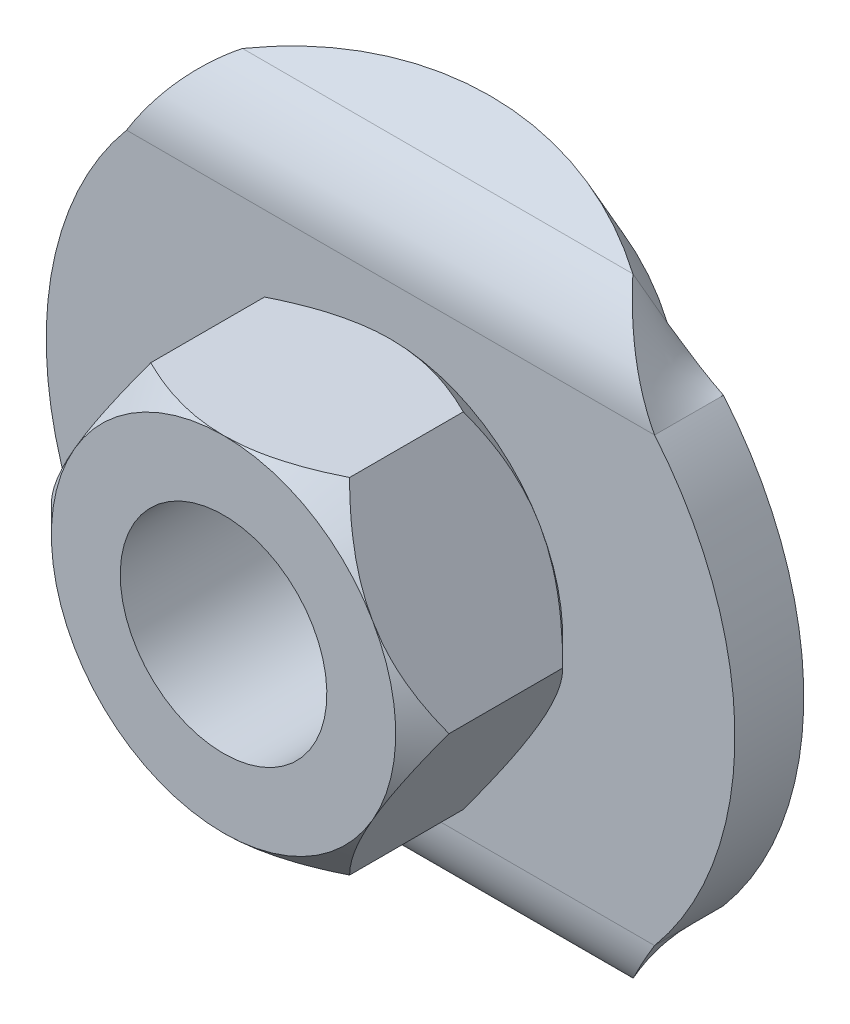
ISO-10303-21;
HEADER;
FILE_DESCRIPTION(('STEP AP214'),'2;1');
FILE_NAME('part.step','',(''),(''),'','','');
FILE_SCHEMA(('AUTOMOTIVE_DESIGN { 1 0 10303 214 1 1 1 1 }'));
ENDSEC;
DATA;
#1=APPLICATION_CONTEXT('core data for automotive mechanical design processes');
#2=APPLICATION_PROTOCOL_DEFINITION('international standard','automotive_design',2000,#1);
#3=PRODUCT_CONTEXT('',#1,'mechanical');
#4=PRODUCT('Part','Part','',(#3));
#5=PRODUCT_RELATED_PRODUCT_CATEGORY('part','',(#4));
#6=PRODUCT_DEFINITION_FORMATION('','',#4);
#7=PRODUCT_DEFINITION_CONTEXT('part definition',#1,'design');
#8=PRODUCT_DEFINITION('design','',#6,#7);
#9=PRODUCT_DEFINITION_SHAPE('','',#8);
#10=(LENGTH_UNIT() NAMED_UNIT(*) SI_UNIT(.MILLI.,.METRE.));
#11=(NAMED_UNIT(*) PLANE_ANGLE_UNIT() SI_UNIT($,.RADIAN.));
#12=(NAMED_UNIT(*) SI_UNIT($,.STERADIAN.) SOLID_ANGLE_UNIT());
#13=UNCERTAINTY_MEASURE_WITH_UNIT(LENGTH_MEASURE(1.E-05),#10,'distance_accuracy_value','');
#14=(GEOMETRIC_REPRESENTATION_CONTEXT(3) GLOBAL_UNCERTAINTY_ASSIGNED_CONTEXT((#13)) GLOBAL_UNIT_ASSIGNED_CONTEXT((#10,
#11,#12)) REPRESENTATION_CONTEXT('',''));
#15=CARTESIAN_POINT('',(0.,0.,0.));
#16=DIRECTION('',(0.,0.,1.));
#17=DIRECTION('',(1.,0.,0.));
#18=AXIS2_PLACEMENT_3D('',#15,#16,#17);
#19=CARTESIAN_POINT('',(0.,0.,0.));
#20=DIRECTION('',(0.,0.,1.));
#21=DIRECTION('',(-1.,0.,0.));
#22=AXIS2_PLACEMENT_3D('',#19,#20,#21);
#23=CYLINDRICAL_SURFACE('',#22,3.);
#24=CARTESIAN_POINT('',(0.,0.,6.85));
#25=DIRECTION('',(0.,0.,-1.));
#26=DIRECTION('',(0.866025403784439,0.5,0.));
#27=AXIS2_PLACEMENT_3D('',#24,#25,#26);
#28=CIRCLE('',#27,3.);
#29=CARTESIAN_POINT('',(2.5980762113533,1.50000000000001,6.85));
#30=VERTEX_POINT('',#29);
#31=EDGE_CURVE('E754',#30,#30,#28,.T.);
#32=ORIENTED_EDGE('',*,*,#31,.F.);
#33=EDGE_LOOP('',(#32));
#34=FACE_BOUND('',#33,.T.);
#35=CARTESIAN_POINT('',(0.,0.,0.));
#36=DIRECTION('',(0.,0.,-1.));
#37=DIRECTION('',(1.,0.,0.));
#38=AXIS2_PLACEMENT_3D('',#35,#36,#37);
#39=CIRCLE('',#38,3.);
#40=CARTESIAN_POINT('',(2.99999999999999,0.,0.));
#41=VERTEX_POINT('',#40);
#42=EDGE_CURVE('E1949',#41,#41,#39,.T.);
#43=ORIENTED_EDGE('',*,*,#42,.T.);
#44=EDGE_LOOP('',(#43));
#45=FACE_BOUND('',#44,.T.);
#46=ADVANCED_FACE('F14',(#34,#45),#23,.F.);
#47=CARTESIAN_POINT('',(0.,0.,0.));
#48=DIRECTION('',(0.,0.,1.));
#49=DIRECTION('',(-1.,0.,0.));
#50=AXIS2_PLACEMENT_3D('',#47,#48,#49);
#51=CYLINDRICAL_SURFACE('',#50,10.);
#52=CARTESIAN_POINT('',(0.,0.,0.));
#53=DIRECTION('',(0.,0.,-1.));
#54=DIRECTION('',(1.,0.,0.));
#55=AXIS2_PLACEMENT_3D('',#52,#53,#54);
#56=CIRCLE('',#55,10.);
#57=CARTESIAN_POINT('',(-7.6670268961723,-6.42002325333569,4.49395382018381E-09));
#58=VERTEX_POINT('',#57);
#59=CARTESIAN_POINT('',(-7.6670268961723,6.42002325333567,4.49392606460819E-09));
#60=VERTEX_POINT('',#59);
#61=EDGE_CURVE('E1551',#58,#60,#56,.T.);
#62=ORIENTED_EDGE('',*,*,#61,.F.);
#63=CARTESIAN_POINT('',(-7.6670268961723,-6.42002325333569,4.49395382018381E-09));
#64=CARTESIAN_POINT('',(-7.66702689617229,-6.42002325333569,0.666666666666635));
#65=CARTESIAN_POINT('',(-7.66702689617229,-6.42002325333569,1.33333333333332));
#66=CARTESIAN_POINT('',(-7.6670268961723,-6.42002325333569,2.));
#67=(BOUNDED_CURVE() B_SPLINE_CURVE(3,(#63,#64,#65,#66),.UNSPECIFIED.,.F.,
.F.) B_SPLINE_CURVE_WITH_KNOTS((4,4),(0.,1.),
.UNSPECIFIED.) CURVE() GEOMETRIC_REPRESENTATION_ITEM() RATIONAL_B_SPLINE_CURVE((1.,1.,1.,1.)) REPRESENTATION_ITEM(''));
#68=CARTESIAN_POINT('',(-7.6670268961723,-6.42002325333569,2.));
#69=VERTEX_POINT('',#68);
#70=EDGE_CURVE('E1567',#58,#69,#67,.T.);
#71=ORIENTED_EDGE('',*,*,#70,.T.);
#72=CARTESIAN_POINT('',(0.,0.,2.));
#73=DIRECTION('',(0.,0.,-1.));
#74=DIRECTION('',(1.,0.,0.));
#75=AXIS2_PLACEMENT_3D('',#72,#73,#74);
#76=CIRCLE('',#75,10.);
#77=CARTESIAN_POINT('',(-7.66702689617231,6.42002325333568,2.00000000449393));
#78=VERTEX_POINT('',#77);
#79=EDGE_CURVE('E1650',#69,#78,#76,.T.);
#80=ORIENTED_EDGE('',*,*,#79,.T.);
#81=CARTESIAN_POINT('',(-7.66702689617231,6.42002325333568,2.00000000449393));
#82=CARTESIAN_POINT('',(-7.66702689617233,6.42002325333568,1.33333333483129));
#83=CARTESIAN_POINT('',(-7.66702689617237,6.42002325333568,0.666666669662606));
#84=CARTESIAN_POINT('',(-7.6670268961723,6.42002325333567,4.49392606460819E-09));
#85=(BOUNDED_CURVE() B_SPLINE_CURVE(3,(#81,#82,#83,#84),.UNSPECIFIED.,.F.,
.F.) B_SPLINE_CURVE_WITH_KNOTS((4,4),(0.,1.),
.UNSPECIFIED.) CURVE() GEOMETRIC_REPRESENTATION_ITEM() RATIONAL_B_SPLINE_CURVE((1.,1.,1.,1.)) REPRESENTATION_ITEM(''));
#86=EDGE_CURVE('E1703',#78,#60,#85,.T.);
#87=ORIENTED_EDGE('',*,*,#86,.T.);
#88=EDGE_LOOP('',(#62,#71,#80,#87));
#89=FACE_BOUND('',#88,.T.);
#90=ADVANCED_FACE('F1117',(#89),#51,.T.);
#91=CARTESIAN_POINT('',(0.,0.,2.));
#92=DIRECTION('',(0.,0.,-1.));
#93=DIRECTION('',(1.,0.,0.));
#94=AXIS2_PLACEMENT_3D('',#91,#92,#93);
#95=PLANE('',#94);
#96=CARTESIAN_POINT('',(0.,0.,2.));
#97=DIRECTION('',(0.,0.,-1.));
#98=DIRECTION('',(1.,0.,0.));
#99=AXIS2_PLACEMENT_3D('',#96,#97,#98);
#100=CIRCLE('',#99,5.);
#101=CARTESIAN_POINT('',(-4.3301270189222,2.5,2.));
#102=VERTEX_POINT('',#101);
#103=CARTESIAN_POINT('',(0.,5.,2.));
#104=VERTEX_POINT('',#103);
#105=EDGE_CURVE('E28',#102,#104,#100,.T.);
#106=ORIENTED_EDGE('',*,*,#105,.T.);
#107=CARTESIAN_POINT('',(0.,0.,2.));
#108=DIRECTION('',(0.,0.,-1.));
#109=DIRECTION('',(1.,0.,0.));
#110=AXIS2_PLACEMENT_3D('',#107,#108,#109);
#111=CIRCLE('',#110,5.);
#112=CARTESIAN_POINT('',(4.33012701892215,2.5,2.));
#113=VERTEX_POINT('',#112);
#114=EDGE_CURVE('E9',#104,#113,#111,.T.);
#115=ORIENTED_EDGE('',*,*,#114,.T.);
#116=CARTESIAN_POINT('',(0.,0.,2.));
#117=DIRECTION('',(0.,0.,-1.));
#118=DIRECTION('',(1.,0.,0.));
#119=AXIS2_PLACEMENT_3D('',#116,#117,#118);
#120=CIRCLE('',#119,5.);
#121=CARTESIAN_POINT('',(4.33012701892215,-2.5,2.));
#122=VERTEX_POINT('',#121);
#123=EDGE_CURVE('E1076',#113,#122,#120,.T.);
#124=ORIENTED_EDGE('',*,*,#123,.T.);
#125=CARTESIAN_POINT('',(0.,0.,2.));
#126=DIRECTION('',(0.,0.,-1.));
#127=DIRECTION('',(1.,0.,0.));
#128=AXIS2_PLACEMENT_3D('',#125,#126,#127);
#129=CIRCLE('',#128,5.);
#130=CARTESIAN_POINT('',(0.,-5.,2.00000000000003));
#131=VERTEX_POINT('',#130);
#132=EDGE_CURVE('E130',#122,#131,#129,.T.);
#133=ORIENTED_EDGE('',*,*,#132,.T.);
#134=CARTESIAN_POINT('',(0.,0.,2.));
#135=DIRECTION('',(0.,0.,-1.));
#136=DIRECTION('',(1.,0.,0.));
#137=AXIS2_PLACEMENT_3D('',#134,#135,#136);
#138=CIRCLE('',#137,5.);
#139=CARTESIAN_POINT('',(-4.3301270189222,-2.5,2.00000000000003));
#140=VERTEX_POINT('',#139);
#141=EDGE_CURVE('E1086',#131,#140,#138,.T.);
#142=ORIENTED_EDGE('',*,*,#141,.T.);
#143=CARTESIAN_POINT('',(0.,0.,2.));
#144=DIRECTION('',(0.,0.,-1.));
#145=DIRECTION('',(1.,0.,0.));
#146=AXIS2_PLACEMENT_3D('',#143,#144,#145);
#147=CIRCLE('',#146,5.);
#148=EDGE_CURVE('E317',#140,#102,#147,.T.);
#149=ORIENTED_EDGE('',*,*,#148,.T.);
#150=EDGE_LOOP('',(#106,#115,#124,#133,#142,#149));
#151=FACE_BOUND('',#150,.T.);
#152=CARTESIAN_POINT('',(0.,0.,2.));
#153=DIRECTION('',(0.,0.,-1.));
#154=DIRECTION('',(1.,0.,0.));
#155=AXIS2_PLACEMENT_3D('',#152,#153,#154);
#156=CIRCLE('',#155,10.);
#157=CARTESIAN_POINT('',(7.66702689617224,6.42002325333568,2.00000000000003));
#158=VERTEX_POINT('',#157);
#159=CARTESIAN_POINT('',(7.66702689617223,-6.42002325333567,2.00000000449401));
#160=VERTEX_POINT('',#159);
#161=EDGE_CURVE('E1579',#158,#160,#156,.T.);
#162=ORIENTED_EDGE('',*,*,#161,.F.);
#163=DIRECTION('',(-1.,0.,0.));
#164=VECTOR('',#163,1.);
#165=CARTESIAN_POINT('',(0.,6.42002325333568,2.));
#166=LINE('',#165,#164);
#167=EDGE_CURVE('E1698',#158,#78,#166,.T.);
#168=ORIENTED_EDGE('',*,*,#167,.T.);
#169=ORIENTED_EDGE('',*,*,#79,.F.);
#170=DIRECTION('',(1.,0.,0.));
#171=VECTOR('',#170,1.);
#172=CARTESIAN_POINT('',(0.,-6.42002325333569,2.00000000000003));
#173=LINE('',#172,#171);
#174=EDGE_CURVE('E1578',#69,#160,#173,.T.);
#175=ORIENTED_EDGE('',*,*,#174,.T.);
#176=EDGE_LOOP('',(#162,#168,#169,#175));
#177=FACE_BOUND('',#176,.T.);
#178=ADVANCED_FACE('F1087',(#151,#177),#95,.F.);
#179=CARTESIAN_POINT('',(0.,0.,0.));
#180=DIRECTION('',(0.,0.,1.));
#181=DIRECTION('',(-1.,0.,0.));
#182=AXIS2_PLACEMENT_3D('',#179,#180,#181);
#183=CYLINDRICAL_SURFACE('',#182,10.);
#184=CARTESIAN_POINT('',(0.,0.,0.));
#185=DIRECTION('',(0.,0.,-1.));
#186=DIRECTION('',(1.,0.,0.));
#187=AXIS2_PLACEMENT_3D('',#184,#185,#186);
#188=CIRCLE('',#187,10.);
#189=CARTESIAN_POINT('',(7.66702689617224,6.42002325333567,4.49396769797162E-09));
#190=VERTEX_POINT('',#189);
#191=CARTESIAN_POINT('',(7.66702689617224,-6.42002325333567,4.49399545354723E-09));
#192=VERTEX_POINT('',#191);
#193=EDGE_CURVE('E1549',#190,#192,#188,.T.);
#194=ORIENTED_EDGE('',*,*,#193,.F.);
#195=CARTESIAN_POINT('',(7.66702689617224,6.42002325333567,4.49396769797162E-09));
#196=CARTESIAN_POINT('',(7.66702689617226,6.42002325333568,0.666666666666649));
#197=CARTESIAN_POINT('',(7.66702689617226,6.42002325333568,1.33333333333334));
#198=CARTESIAN_POINT('',(7.66702689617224,6.42002325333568,2.00000000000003));
#199=(BOUNDED_CURVE() B_SPLINE_CURVE(3,(#195,#196,#197,#198),.UNSPECIFIED.,.F.,
.F.) B_SPLINE_CURVE_WITH_KNOTS((4,4),(0.,1.),
.UNSPECIFIED.) CURVE() GEOMETRIC_REPRESENTATION_ITEM() RATIONAL_B_SPLINE_CURVE((1.,1.,1.,1.)) REPRESENTATION_ITEM(''));
#200=EDGE_CURVE('E1562',#190,#158,#199,.T.);
#201=ORIENTED_EDGE('',*,*,#200,.T.);
#202=ORIENTED_EDGE('',*,*,#161,.T.);
#203=CARTESIAN_POINT('',(7.66702689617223,-6.42002325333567,2.00000000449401));
#204=CARTESIAN_POINT('',(7.66702689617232,-6.42002325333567,1.33333333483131));
#205=CARTESIAN_POINT('',(7.66702689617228,-6.42002325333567,0.666666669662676));
#206=CARTESIAN_POINT('',(7.66702689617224,-6.42002325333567,4.49399545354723E-09));
#207=(BOUNDED_CURVE() B_SPLINE_CURVE(3,(#203,#204,#205,#206),.UNSPECIFIED.,.F.,
.F.) B_SPLINE_CURVE_WITH_KNOTS((4,4),(0.,1.),
.UNSPECIFIED.) CURVE() GEOMETRIC_REPRESENTATION_ITEM() RATIONAL_B_SPLINE_CURVE((1.,1.,1.,1.)) REPRESENTATION_ITEM(''));
#208=EDGE_CURVE('E1564',#160,#192,#207,.T.);
#209=ORIENTED_EDGE('',*,*,#208,.T.);
#210=EDGE_LOOP('',(#194,#201,#202,#209));
#211=FACE_BOUND('',#210,.T.);
#212=ADVANCED_FACE('F1150',(#211),#183,.T.);
#213=CARTESIAN_POINT('',(0.,0.,0.));
#214=DIRECTION('',(0.,0.,-1.));
#215=DIRECTION('',(1.,0.,0.));
#216=AXIS2_PLACEMENT_3D('',#213,#214,#215);
#217=PLANE('',#216);
#218=DIRECTION('',(-1.,0.,0.));
#219=VECTOR('',#218,1.);
#220=CARTESIAN_POINT('',(0.,6.42002325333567,0.));
#221=LINE('',#220,#219);
#222=EDGE_CURVE('E1545',#190,#60,#221,.T.);
#223=ORIENTED_EDGE('',*,*,#222,.F.);
#224=ORIENTED_EDGE('',*,*,#193,.T.);
#225=DIRECTION('',(1.,0.,0.));
#226=VECTOR('',#225,1.);
#227=CARTESIAN_POINT('',(0.,-6.42002325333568,0.));
#228=LINE('',#227,#226);
#229=EDGE_CURVE('E1868',#58,#192,#228,.T.);
#230=ORIENTED_EDGE('',*,*,#229,.F.);
#231=ORIENTED_EDGE('',*,*,#61,.T.);
#232=EDGE_LOOP('',(#223,#224,#230,#231));
#233=FACE_BOUND('',#232,.T.);
#234=ORIENTED_EDGE('',*,*,#42,.F.);
#235=EDGE_LOOP('',(#234));
#236=FACE_BOUND('',#235,.T.);
#237=ADVANCED_FACE('F1161',(#233,#236),#217,.T.);
#238=CARTESIAN_POINT('',(-5.66795308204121,-8.78998837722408,0.631700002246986));
#239=CARTESIAN_POINT('',(-5.89681194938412,-8.64591131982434,0.881248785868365));
#240=CARTESIAN_POINT('',(-6.10991455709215,-8.46888939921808,1.09657074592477));
#241=CARTESIAN_POINT('',(-6.50525495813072,-8.08160135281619,1.45372547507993));
#242=CARTESIAN_POINT('',(-6.68738480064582,-7.87151274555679,1.59560704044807));
#243=CARTESIAN_POINT('',(-7.18715325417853,-7.23264644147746,1.91985449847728));
#244=CARTESIAN_POINT('',(-7.45898194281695,-6.79776767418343,2.00000000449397));
#245=CARTESIAN_POINT('',(-7.66702689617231,-6.42002325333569,2.00000000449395));
#246=CARTESIAN_POINT('',(-5.6679530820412,-7.0579375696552,-0.368299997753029));
#247=CARTESIAN_POINT('',(-5.89672213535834,-7.01917212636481,-0.301156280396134));
#248=CARTESIAN_POINT('',(-6.10991455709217,-6.97150860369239,-0.243172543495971));
#249=CARTESIAN_POINT('',(-6.50525495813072,-6.86726378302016,-0.147038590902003));
#250=CARTESIAN_POINT('',(-6.68738480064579,-6.81071504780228,-0.10884888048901));
#251=CARTESIAN_POINT('',(-7.1871532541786,-6.6387538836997,-0.0215724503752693));
#252=CARTESIAN_POINT('',(-7.45837461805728,-6.52199606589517,4.49397463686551E-09));
#253=CARTESIAN_POINT('',(-7.6670268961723,-6.42002325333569,4.49395382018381E-09));
#254=(BOUNDED_SURFACE() B_SPLINE_SURFACE(1,3,((#238,#239,#240,#241,#242,#243,#244,#245),(#246,
#247,#248,#249,#250,#251,#252,#253)),.UNSPECIFIED.,.F.,.F.,.F.) B_SPLINE_SURFACE_WITH_KNOTS((2,
2),(4,2,2,4),(0.,1.),(0.,0.25,0.5,1.),
.UNSPECIFIED.) GEOMETRIC_REPRESENTATION_ITEM() RATIONAL_B_SPLINE_SURFACE(((1.,1.,1.,1.,1.,1.,1.,
1.),(1.,1.,1.,1.,1.,1.,1.,1.))) REPRESENTATION_ITEM('') SURFACE());
#255=CARTESIAN_POINT('',(-5.6679530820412,-7.0579375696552,-0.368299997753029));
#256=CARTESIAN_POINT('',(-5.6679530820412,-8.78998837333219,0.631699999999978));
#257=(BOUNDED_CURVE() B_SPLINE_CURVE(1,(#255,#256),.UNSPECIFIED.,.F.,
.F.) B_SPLINE_CURVE_WITH_KNOTS((2,2),(0.,1.),
.UNSPECIFIED.) CURVE() GEOMETRIC_REPRESENTATION_ITEM() RATIONAL_B_SPLINE_CURVE((1.,1.)) REPRESENTATION_ITEM(''));
#258=CARTESIAN_POINT('',(-5.6679530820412,-7.0579375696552,-0.368299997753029));
#259=VERTEX_POINT('',#258);
#260=CARTESIAN_POINT('',(-5.6679530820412,-8.78998837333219,0.631699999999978));
#261=VERTEX_POINT('',#260);
#262=EDGE_CURVE('E1807',#259,#261,#257,.T.);
#263=CARTESIAN_POINT('',(-5.66795308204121,-8.78998837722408,0.631700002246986));
#264=CARTESIAN_POINT('',(-5.89681194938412,-8.64591131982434,0.881248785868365));
#265=CARTESIAN_POINT('',(-6.10991455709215,-8.46888939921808,1.09657074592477));
#266=CARTESIAN_POINT('',(-6.50525495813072,-8.08160135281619,1.45372547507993));
#267=CARTESIAN_POINT('',(-6.68738480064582,-7.87151274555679,1.59560704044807));
#268=CARTESIAN_POINT('',(-7.18715325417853,-7.23264644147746,1.91985449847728));
#269=CARTESIAN_POINT('',(-7.45898194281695,-6.79776767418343,2.00000000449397));
#270=CARTESIAN_POINT('',(-7.66702689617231,-6.42002325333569,2.00000000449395));
#271=(BOUNDED_CURVE() B_SPLINE_CURVE(3,(#263,#264,#265,#266,#267,#268,#269,#270),.UNSPECIFIED.,
.F.,.F.) B_SPLINE_CURVE_WITH_KNOTS((4,2,2,4),(0.,0.25,0.5,1.),
.UNSPECIFIED.) CURVE() GEOMETRIC_REPRESENTATION_ITEM() RATIONAL_B_SPLINE_CURVE((1.,1.,1.,1.,1.,
1.,1.,1.)) REPRESENTATION_ITEM(''));
#272=EDGE_CURVE('E1792',#261,#69,#271,.T.);
#273=CARTESIAN_POINT('',(-7.6670268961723,-6.42002325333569,4.49395382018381E-09));
#274=CARTESIAN_POINT('',(-7.45837461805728,-6.52199606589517,4.49397463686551E-09));
#275=CARTESIAN_POINT('',(-7.1871532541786,-6.6387538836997,-0.0215724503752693));
#276=CARTESIAN_POINT('',(-6.68738480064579,-6.81071504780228,-0.10884888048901));
#277=CARTESIAN_POINT('',(-6.50525495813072,-6.86726378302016,-0.147038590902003));
#278=CARTESIAN_POINT('',(-6.10991455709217,-6.97150860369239,-0.243172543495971));
#279=CARTESIAN_POINT('',(-5.89672213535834,-7.01917212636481,-0.301156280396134));
#280=CARTESIAN_POINT('',(-5.6679530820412,-7.0579375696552,-0.368299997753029));
#281=(BOUNDED_CURVE() B_SPLINE_CURVE(3,(#273,#274,#275,#276,#277,#278,#279,#280),.UNSPECIFIED.,
.F.,.F.) B_SPLINE_CURVE_WITH_KNOTS((4,2,2,4),(0.,0.5,0.75,1.),
.UNSPECIFIED.) CURVE() GEOMETRIC_REPRESENTATION_ITEM() RATIONAL_B_SPLINE_CURVE((1.,1.,1.,1.,1.,
1.,1.,1.)) REPRESENTATION_ITEM(''));
#282=EDGE_CURVE('E1757',#259,#58,#281,.F.);
#283=ORIENTED_EDGE('',*,*,#262,.T.);
#284=ORIENTED_EDGE('',*,*,#272,.T.);
#285=ORIENTED_EDGE('',*,*,#70,.F.);
#286=ORIENTED_EDGE('',*,*,#282,.F.);
#287=EDGE_LOOP('',(#283,#284,#285,#286));
#288=FACE_BOUND('',#287,.T.);
#289=ADVANCED_FACE('F1173',(#288),#254,.F.);
#290=CARTESIAN_POINT('',(15.5704970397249,-6.42002325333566,-0.736599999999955));
#291=DIRECTION('',(-1.,0.,0.));
#292=DIRECTION('',(0.,0.,-1.));
#293=AXIS2_PLACEMENT_3D('',#290,#291,#292);
#294=CYLINDRICAL_SURFACE('',#293,0.736600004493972);
#295=ORIENTED_EDGE('',*,*,#229,.T.);
#296=CARTESIAN_POINT('',(5.66795308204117,-7.05793756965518,-0.36829999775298));
#297=CARTESIAN_POINT('',(5.80588371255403,-7.03655708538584,-0.331267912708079));
#298=CARTESIAN_POINT('',(5.95099883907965,-7.00923959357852,-0.291326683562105));
#299=CARTESIAN_POINT('',(6.25553025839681,-6.93868187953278,-0.210826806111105));
#300=CARTESIAN_POINT('',(6.41495785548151,-6.89538087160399,-0.170254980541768));
#301=CARTESIAN_POINT('',(6.74813682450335,-6.79009669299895,-0.0964772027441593));
#302=CARTESIAN_POINT('',(6.92188819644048,-6.72803518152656,-0.0632954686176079));
#303=CARTESIAN_POINT('',(7.28371471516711,-6.58593593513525,-0.0150161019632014));
#304=CARTESIAN_POINT('',(7.47174915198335,-6.50583762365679,4.49398157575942E-09));
#305=CARTESIAN_POINT('',(7.66702689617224,-6.42002325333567,4.49399545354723E-09));
#306=(BOUNDED_CURVE() B_SPLINE_CURVE(3,(#296,#297,#298,#299,#300,#301,#302,#303,#304,#305),
.UNSPECIFIED.,.F.,.F.) B_SPLINE_CURVE_WITH_KNOTS((4,2,2,2,4),(0.,0.25,0.5,0.75,1.),
.UNSPECIFIED.) CURVE() GEOMETRIC_REPRESENTATION_ITEM() RATIONAL_B_SPLINE_CURVE((1.,1.,1.,1.,1.,
1.,1.,1.,1.,1.)) REPRESENTATION_ITEM(''));
#307=CARTESIAN_POINT('',(5.66795308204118,-7.05793756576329,-0.368299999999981));
#308=VERTEX_POINT('',#307);
#309=EDGE_CURVE('E1728',#192,#308,#306,.F.);
#310=ORIENTED_EDGE('',*,*,#309,.T.);
#311=DIRECTION('',(1.,0.,0.));
#312=VECTOR('',#311,1.);
#313=CARTESIAN_POINT('',(0.,-7.0579375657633,-0.3683));
#314=LINE('',#313,#312);
#315=EDGE_CURVE('E1820',#259,#308,#314,.T.);
#316=ORIENTED_EDGE('',*,*,#315,.F.);
#317=ORIENTED_EDGE('',*,*,#282,.T.);
#318=EDGE_LOOP('',(#295,#310,#316,#317));
#319=FACE_BOUND('',#318,.T.);
#320=ADVANCED_FACE('F1184',(#319),#294,.F.);
#321=CARTESIAN_POINT('',(7.66702689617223,-6.42002325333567,2.00000000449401));
#322=CARTESIAN_POINT('',(7.47160696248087,-6.73907104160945,2.00000000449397));
#323=CARTESIAN_POINT('',(7.28371471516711,-7.0364183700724,1.94421249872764));
#324=CARTESIAN_POINT('',(6.92188819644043,-7.56434233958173,1.76484606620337));
#325=CARTESIAN_POINT('',(6.74813682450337,-7.79491189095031,1.64157002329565));
#326=CARTESIAN_POINT('',(6.41495785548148,-8.18606133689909,1.36747245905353));
#327=CARTESIAN_POINT('',(6.25553025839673,-8.34693228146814,1.21674091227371));
#328=CARTESIAN_POINT('',(5.95099883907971,-8.60906673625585,0.917669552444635));
#329=CARTESIAN_POINT('',(5.80582150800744,-8.71059189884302,0.769218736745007));
#330=CARTESIAN_POINT('',(5.66795308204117,-8.78998837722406,0.631700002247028));
#331=CARTESIAN_POINT('',(7.66702689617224,-6.42002325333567,4.49399545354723E-09));
#332=CARTESIAN_POINT('',(7.47174915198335,-6.50583762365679,4.49398157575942E-09));
#333=CARTESIAN_POINT('',(7.28371471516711,-6.58593593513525,-0.0150161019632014));
#334=CARTESIAN_POINT('',(6.92188819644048,-6.72803518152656,-0.0632954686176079));
#335=CARTESIAN_POINT('',(6.74813682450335,-6.79009669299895,-0.0964772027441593));
#336=CARTESIAN_POINT('',(6.41495785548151,-6.89538087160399,-0.170254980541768));
#337=CARTESIAN_POINT('',(6.25553025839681,-6.93868187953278,-0.210826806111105));
#338=CARTESIAN_POINT('',(5.95099883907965,-7.00923959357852,-0.291326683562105));
#339=CARTESIAN_POINT('',(5.80588371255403,-7.03655708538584,-0.331267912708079));
#340=CARTESIAN_POINT('',(5.66795308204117,-7.05793756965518,-0.36829999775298));
#341=(BOUNDED_SURFACE() B_SPLINE_SURFACE(1,3,((#321,#322,#323,#324,#325,#326,#327,#328,#329,
#330),(#331,#332,#333,#334,#335,#336,#337,#338,#339,#340)),.UNSPECIFIED.,.F.,.F.,
.F.) B_SPLINE_SURFACE_WITH_KNOTS((2,2),(4,2,2,2,4),(0.,1.),(0.,0.25,0.5,0.75,1.),
.UNSPECIFIED.) GEOMETRIC_REPRESENTATION_ITEM() RATIONAL_B_SPLINE_SURFACE(((1.,1.,1.,1.,1.,1.,1.,
1.,1.,1.),(1.,1.,1.,1.,1.,1.,1.,1.,1.,1.))) REPRESENTATION_ITEM('') SURFACE());
#342=CARTESIAN_POINT('',(7.66702689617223,-6.42002325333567,2.00000000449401));
#343=CARTESIAN_POINT('',(7.47160696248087,-6.73907104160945,2.00000000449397));
#344=CARTESIAN_POINT('',(7.28371471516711,-7.0364183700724,1.94421249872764));
#345=CARTESIAN_POINT('',(6.92188819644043,-7.56434233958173,1.76484606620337));
#346=CARTESIAN_POINT('',(6.74813682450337,-7.79491189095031,1.64157002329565));
#347=CARTESIAN_POINT('',(6.41495785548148,-8.18606133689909,1.36747245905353));
#348=CARTESIAN_POINT('',(6.25553025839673,-8.34693228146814,1.21674091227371));
#349=CARTESIAN_POINT('',(5.95099883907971,-8.60906673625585,0.917669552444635));
#350=CARTESIAN_POINT('',(5.80582150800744,-8.71059189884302,0.769218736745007));
#351=CARTESIAN_POINT('',(5.66795308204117,-8.78998837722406,0.631700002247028));
#352=(BOUNDED_CURVE() B_SPLINE_CURVE(3,(#342,#343,#344,#345,#346,#347,#348,#349,#350,#351),
.UNSPECIFIED.,.F.,.F.) B_SPLINE_CURVE_WITH_KNOTS((4,2,2,2,4),(0.,0.25,0.5,0.75,1.),
.UNSPECIFIED.) CURVE() GEOMETRIC_REPRESENTATION_ITEM() RATIONAL_B_SPLINE_CURVE((1.,1.,1.,1.,1.,
1.,1.,1.,1.,1.)) REPRESENTATION_ITEM(''));
#353=CARTESIAN_POINT('',(5.66795308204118,-8.78998837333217,0.63170000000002));
#354=VERTEX_POINT('',#353);
#355=EDGE_CURVE('E1852',#160,#354,#352,.T.);
#356=CARTESIAN_POINT('',(5.66795308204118,-8.78998837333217,0.63170000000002));
#357=CARTESIAN_POINT('',(5.66795308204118,-7.05793756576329,-0.368299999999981));
#358=(BOUNDED_CURVE() B_SPLINE_CURVE(1,(#356,#357),.UNSPECIFIED.,.F.,
.F.) B_SPLINE_CURVE_WITH_KNOTS((2,2),(0.,1.),
.UNSPECIFIED.) CURVE() GEOMETRIC_REPRESENTATION_ITEM() RATIONAL_B_SPLINE_CURVE((1.,1.)) REPRESENTATION_ITEM(''));
#359=EDGE_CURVE('E1803',#354,#308,#358,.T.);
#360=ORIENTED_EDGE('',*,*,#355,.T.);
#361=ORIENTED_EDGE('',*,*,#359,.T.);
#362=ORIENTED_EDGE('',*,*,#309,.F.);
#363=ORIENTED_EDGE('',*,*,#208,.F.);
#364=EDGE_LOOP('',(#360,#361,#362,#363));
#365=FACE_BOUND('',#364,.T.);
#366=ADVANCED_FACE('F1195',(#365),#341,.F.);
#367=CARTESIAN_POINT('',(15.5704970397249,-6.42002325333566,-0.736599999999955));
#368=DIRECTION('',(-1.,0.,0.));
#369=DIRECTION('',(0.,0.,-1.));
#370=AXIS2_PLACEMENT_3D('',#367,#368,#369);
#371=CYLINDRICAL_SURFACE('',#370,2.73660000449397);
#372=ORIENTED_EDGE('',*,*,#174,.F.);
#373=ORIENTED_EDGE('',*,*,#272,.F.);
#374=DIRECTION('',(1.,0.,0.));
#375=VECTOR('',#374,1.);
#376=CARTESIAN_POINT('',(0.,-8.78998837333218,0.631699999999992));
#377=LINE('',#376,#375);
#378=EDGE_CURVE('E1796',#261,#354,#377,.T.);
#379=ORIENTED_EDGE('',*,*,#378,.T.);
#380=ORIENTED_EDGE('',*,*,#355,.F.);
#381=EDGE_LOOP('',(#372,#373,#379,#380));
#382=FACE_BOUND('',#381,.T.);
#383=ADVANCED_FACE('F1208',(#382),#371,.T.);
#384=CARTESIAN_POINT('',(0.,-2.93864430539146,6.76652521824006));
#385=DIRECTION('',(0.,0.866025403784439,-0.5));
#386=DIRECTION('',(-1.,0.,0.));
#387=AXIS2_PLACEMENT_3D('',#384,#385,#386);
#388=PLANE('',#387);
#389=CARTESIAN_POINT('',(0.,-2.93864430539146,6.76652521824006));
#390=DIRECTION('',(0.,0.866025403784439,-0.5));
#391=DIRECTION('',(1.,0.,0.));
#392=AXIS2_PLACEMENT_3D('',#389,#390,#391);
#393=CIRCLE('',#392,10.);
#394=EDGE_CURVE('E1804',#308,#259,#393,.T.);
#395=ORIENTED_EDGE('',*,*,#394,.T.);
#396=ORIENTED_EDGE('',*,*,#315,.T.);
#397=EDGE_LOOP('',(#395,#396));
#398=FACE_BOUND('',#397,.T.);
#399=ADVANCED_FACE('F1219',(#398),#388,.T.);
#400=CARTESIAN_POINT('',(0.,-2.93864430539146,6.76652521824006));
#401=DIRECTION('',(0.,-0.866025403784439,0.5));
#402=DIRECTION('',(-1.,0.,0.));
#403=AXIS2_PLACEMENT_3D('',#400,#401,#402);
#404=CYLINDRICAL_SURFACE('',#403,10.);
#405=ORIENTED_EDGE('',*,*,#262,.F.);
#406=ORIENTED_EDGE('',*,*,#394,.F.);
#407=ORIENTED_EDGE('',*,*,#359,.F.);
#408=CARTESIAN_POINT('',(0.,-4.67069511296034,7.76652521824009));
#409=DIRECTION('',(0.,0.866025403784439,-0.5));
#410=DIRECTION('',(1.,0.,0.));
#411=AXIS2_PLACEMENT_3D('',#408,#409,#410);
#412=CIRCLE('',#411,10.);
#413=EDGE_CURVE('E1681',#354,#261,#412,.T.);
#414=ORIENTED_EDGE('',*,*,#413,.T.);
#415=EDGE_LOOP('',(#405,#406,#407,#414));
#416=FACE_BOUND('',#415,.T.);
#417=ADVANCED_FACE('F1229',(#416),#404,.T.);
#418=CARTESIAN_POINT('',(0.,-4.67069511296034,7.76652521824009));
#419=DIRECTION('',(0.,0.866025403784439,-0.5));
#420=DIRECTION('',(-1.,0.,0.));
#421=AXIS2_PLACEMENT_3D('',#418,#419,#420);
#422=PLANE('',#421);
#423=ORIENTED_EDGE('',*,*,#378,.F.);
#424=ORIENTED_EDGE('',*,*,#413,.F.);
#425=EDGE_LOOP('',(#423,#424));
#426=FACE_BOUND('',#425,.T.);
#427=ADVANCED_FACE('F1240',(#426),#422,.F.);
#428=CARTESIAN_POINT('',(5.66795308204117,8.78998837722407,0.631700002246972));
#429=CARTESIAN_POINT('',(5.89680730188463,8.64591424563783,0.881243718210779));
#430=CARTESIAN_POINT('',(6.10990645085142,8.46889604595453,1.09656289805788));
#431=CARTESIAN_POINT('',(6.50524221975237,8.08161399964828,1.4537155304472));
#432=CARTESIAN_POINT('',(6.68737090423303,7.87152765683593,1.59559776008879));
#433=CARTESIAN_POINT('',(7.18713935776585,7.23266342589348,1.91984930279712));
#434=CARTESIAN_POINT('',(7.45897259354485,6.79777951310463,2.00000000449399));
#435=CARTESIAN_POINT('',(7.66702689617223,6.42002325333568,2.00000000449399));
#436=CARTESIAN_POINT('',(5.66795308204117,7.05793756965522,-0.368299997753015));
#437=CARTESIAN_POINT('',(5.89671750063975,7.01917291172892,-0.301157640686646));
#438=CARTESIAN_POINT('',(6.10990645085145,6.97151039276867,-0.243174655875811));
#439=CARTESIAN_POINT('',(6.50524221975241,6.86726718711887,-0.147041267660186));
#440=CARTESIAN_POINT('',(6.68737090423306,6.81071906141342,-0.108851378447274));
#441=CARTESIAN_POINT('',(7.18713935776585,6.63875845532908,-0.0215738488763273));
#442=CARTESIAN_POINT('',(7.45836532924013,6.52199921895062,4.49396769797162E-09));
#443=CARTESIAN_POINT('',(7.66702689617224,6.42002325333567,4.49396769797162E-09));
#444=(BOUNDED_SURFACE() B_SPLINE_SURFACE(1,3,((#428,#429,#430,#431,#432,#433,#434,#435),(#436,
#437,#438,#439,#440,#441,#442,#443)),.UNSPECIFIED.,.F.,.F.,.F.) B_SPLINE_SURFACE_WITH_KNOTS((2,
2),(4,2,2,4),(0.,1.),(0.,0.25,0.5,1.),
.UNSPECIFIED.) GEOMETRIC_REPRESENTATION_ITEM() RATIONAL_B_SPLINE_SURFACE(((1.,1.,1.,1.,1.,1.,1.,
1.),(1.,1.,1.,1.,1.,1.,1.,1.))) REPRESENTATION_ITEM('') SURFACE());
#445=CARTESIAN_POINT('',(5.66795308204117,7.05793756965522,-0.368299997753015));
#446=CARTESIAN_POINT('',(5.66795308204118,8.78998837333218,0.63170000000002));
#447=(BOUNDED_CURVE() B_SPLINE_CURVE(1,(#445,#446),.UNSPECIFIED.,.F.,
.F.) B_SPLINE_CURVE_WITH_KNOTS((2,2),(0.,1.),
.UNSPECIFIED.) CURVE() GEOMETRIC_REPRESENTATION_ITEM() RATIONAL_B_SPLINE_CURVE((1.,1.)) REPRESENTATION_ITEM(''));
#448=CARTESIAN_POINT('',(5.66795308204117,7.05793756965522,-0.368299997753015));
#449=VERTEX_POINT('',#448);
#450=CARTESIAN_POINT('',(5.66795308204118,8.78998837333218,0.63170000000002));
#451=VERTEX_POINT('',#450);
#452=EDGE_CURVE('E1678',#449,#451,#447,.T.);
#453=CARTESIAN_POINT('',(5.66795308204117,8.78998837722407,0.631700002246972));
#454=CARTESIAN_POINT('',(5.89680730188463,8.64591424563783,0.881243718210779));
#455=CARTESIAN_POINT('',(6.10990645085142,8.46889604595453,1.09656289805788));
#456=CARTESIAN_POINT('',(6.50524221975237,8.08161399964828,1.4537155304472));
#457=CARTESIAN_POINT('',(6.68737090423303,7.87152765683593,1.59559776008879));
#458=CARTESIAN_POINT('',(7.18713935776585,7.23266342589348,1.91984930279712));
#459=CARTESIAN_POINT('',(7.45897259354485,6.79777951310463,2.00000000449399));
#460=CARTESIAN_POINT('',(7.66702689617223,6.42002325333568,2.00000000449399));
#461=(BOUNDED_CURVE() B_SPLINE_CURVE(3,(#453,#454,#455,#456,#457,#458,#459,#460),.UNSPECIFIED.,
.F.,.F.) B_SPLINE_CURVE_WITH_KNOTS((4,2,2,4),(0.,0.25,0.5,1.),
.UNSPECIFIED.) CURVE() GEOMETRIC_REPRESENTATION_ITEM() RATIONAL_B_SPLINE_CURVE((1.,1.,1.,1.,1.,
1.,1.,1.)) REPRESENTATION_ITEM(''));
#462=EDGE_CURVE('E1556',#451,#158,#461,.T.);
#463=CARTESIAN_POINT('',(7.66702689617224,6.42002325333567,4.49396769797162E-09));
#464=CARTESIAN_POINT('',(7.45836532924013,6.52199921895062,4.49396769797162E-09));
#465=CARTESIAN_POINT('',(7.18713935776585,6.63875845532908,-0.0215738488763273));
#466=CARTESIAN_POINT('',(6.68737090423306,6.81071906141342,-0.108851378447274));
#467=CARTESIAN_POINT('',(6.50524221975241,6.86726718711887,-0.147041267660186));
#468=CARTESIAN_POINT('',(6.10990645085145,6.97151039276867,-0.243174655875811));
#469=CARTESIAN_POINT('',(5.89671750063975,7.01917291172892,-0.301157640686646));
#470=CARTESIAN_POINT('',(5.66795308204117,7.05793756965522,-0.368299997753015));
#471=(BOUNDED_CURVE() B_SPLINE_CURVE(3,(#463,#464,#465,#466,#467,#468,#469,#470),.UNSPECIFIED.,
.F.,.F.) B_SPLINE_CURVE_WITH_KNOTS((4,2,2,4),(0.,0.5,0.75,1.),
.UNSPECIFIED.) CURVE() GEOMETRIC_REPRESENTATION_ITEM() RATIONAL_B_SPLINE_CURVE((1.,1.,1.,1.,1.,
1.,1.,1.)) REPRESENTATION_ITEM(''));
#472=EDGE_CURVE('E1572',#449,#190,#471,.F.);
#473=ORIENTED_EDGE('',*,*,#452,.T.);
#474=ORIENTED_EDGE('',*,*,#462,.T.);
#475=ORIENTED_EDGE('',*,*,#200,.F.);
#476=ORIENTED_EDGE('',*,*,#472,.F.);
#477=EDGE_LOOP('',(#473,#474,#475,#476));
#478=FACE_BOUND('',#477,.T.);
#479=ADVANCED_FACE('F1250',(#478),#444,.F.);
#480=CARTESIAN_POINT('',(-15.5704970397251,6.42002325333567,-0.736600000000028));
#481=DIRECTION('',(1.,0.,0.));
#482=DIRECTION('',(0.,0.,1.));
#483=AXIS2_PLACEMENT_3D('',#480,#481,#482);
#484=CYLINDRICAL_SURFACE('',#483,0.736600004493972);
#485=ORIENTED_EDGE('',*,*,#222,.T.);
#486=CARTESIAN_POINT('',(-5.6679530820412,7.05793756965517,-0.368299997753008));
#487=CARTESIAN_POINT('',(-5.80586200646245,7.03656045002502,-0.33127374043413));
#488=CARTESIAN_POINT('',(-5.95096085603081,7.00924652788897,-0.291336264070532));
#489=CARTESIAN_POINT('',(-6.25547057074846,6.93869490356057,-0.210839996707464));
#490=CARTESIAN_POINT('',(-6.41489274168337,6.89539639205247,-0.170268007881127));
#491=CARTESIAN_POINT('',(-6.74807171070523,6.79011423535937,-0.096487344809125));
#492=CARTESIAN_POINT('',(-6.92182850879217,6.72805220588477,-0.0633028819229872));
#493=CARTESIAN_POINT('',(-7.2836767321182,6.58594758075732,-0.0150184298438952));
#494=CARTESIAN_POINT('',(-7.47172743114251,6.50584435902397,4.49395382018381E-09));
#495=CARTESIAN_POINT('',(-7.6670268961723,6.42002325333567,4.49392606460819E-09));
#496=(BOUNDED_CURVE() B_SPLINE_CURVE(3,(#486,#487,#488,#489,#490,#491,#492,#493,#494,#495),
.UNSPECIFIED.,.F.,.F.) B_SPLINE_CURVE_WITH_KNOTS((4,2,2,2,4),(0.,0.25,0.5,0.75,1.),
.UNSPECIFIED.) CURVE() GEOMETRIC_REPRESENTATION_ITEM() RATIONAL_B_SPLINE_CURVE((1.,1.,1.,1.,1.,
1.,1.,1.,1.,1.)) REPRESENTATION_ITEM(''));
#497=CARTESIAN_POINT('',(-5.6679530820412,7.05793756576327,-0.368300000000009));
#498=VERTEX_POINT('',#497);
#499=EDGE_CURVE('E1557',#60,#498,#496,.F.);
#500=ORIENTED_EDGE('',*,*,#499,.T.);
#501=DIRECTION('',(-1.,0.,0.));
#502=VECTOR('',#501,1.);
#503=CARTESIAN_POINT('',(0.,7.05793756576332,-0.368299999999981));
#504=LINE('',#503,#502);
#505=EDGE_CURVE('E1582',#449,#498,#504,.T.);
#506=ORIENTED_EDGE('',*,*,#505,.F.);
#507=ORIENTED_EDGE('',*,*,#472,.T.);
#508=EDGE_LOOP('',(#485,#500,#506,#507));
#509=FACE_BOUND('',#508,.T.);
#510=ADVANCED_FACE('F1261',(#509),#484,.F.);
#511=CARTESIAN_POINT('',(-7.66702689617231,6.42002325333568,2.00000000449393));
#512=CARTESIAN_POINT('',(-7.47158517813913,6.73909616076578,2.00000000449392));
#513=CARTESIAN_POINT('',(-7.28367673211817,7.03646163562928,1.94420385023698));
#514=CARTESIAN_POINT('',(-6.92182850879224,7.56440558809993,1.76481852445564));
#515=CARTESIAN_POINT('',(-6.74807171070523,7.79497706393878,1.64153234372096));
#516=CARTESIAN_POINT('',(-6.41489274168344,8.18611899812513,1.36742406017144));
#517=CARTESIAN_POINT('',(-6.25547057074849,8.34698066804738,1.21669190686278));
#518=CARTESIAN_POINT('',(-5.95096085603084,8.60909249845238,0.917633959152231));
#519=CARTESIAN_POINT('',(-5.80579979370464,8.71060440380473,0.769197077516));
#520=CARTESIAN_POINT('',(-5.66795308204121,8.78998837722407,0.631700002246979));
#521=CARTESIAN_POINT('',(-7.6670268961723,6.42002325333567,4.49392606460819E-09));
#522=CARTESIAN_POINT('',(-7.47172743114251,6.50584435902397,4.49395382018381E-09));
#523=CARTESIAN_POINT('',(-7.2836767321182,6.58594758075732,-0.0150184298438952));
#524=CARTESIAN_POINT('',(-6.92182850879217,6.72805220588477,-0.0633028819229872));
#525=CARTESIAN_POINT('',(-6.74807171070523,6.79011423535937,-0.096487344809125));
#526=CARTESIAN_POINT('',(-6.41489274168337,6.89539639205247,-0.170268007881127));
#527=CARTESIAN_POINT('',(-6.25547057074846,6.93869490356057,-0.210839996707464));
#528=CARTESIAN_POINT('',(-5.95096085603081,7.00924652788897,-0.291336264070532));
#529=CARTESIAN_POINT('',(-5.80586200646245,7.03656045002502,-0.33127374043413));
#530=CARTESIAN_POINT('',(-5.6679530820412,7.05793756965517,-0.368299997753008));
#531=(BOUNDED_SURFACE() B_SPLINE_SURFACE(1,3,((#511,#512,#513,#514,#515,#516,#517,#518,#519,
#520),(#521,#522,#523,#524,#525,#526,#527,#528,#529,#530)),.UNSPECIFIED.,.F.,.F.,
.F.) B_SPLINE_SURFACE_WITH_KNOTS((2,2),(4,2,2,2,4),(0.,1.),(0.,0.25,0.5,0.75,1.),
.UNSPECIFIED.) GEOMETRIC_REPRESENTATION_ITEM() RATIONAL_B_SPLINE_SURFACE(((1.,1.,1.,1.,1.,1.,1.,
1.,1.,1.),(1.,1.,1.,1.,1.,1.,1.,1.,1.,1.))) REPRESENTATION_ITEM('') SURFACE());
#532=CARTESIAN_POINT('',(-7.66702689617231,6.42002325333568,2.00000000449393));
#533=CARTESIAN_POINT('',(-7.47158517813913,6.73909616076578,2.00000000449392));
#534=CARTESIAN_POINT('',(-7.28367673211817,7.03646163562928,1.94420385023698));
#535=CARTESIAN_POINT('',(-6.92182850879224,7.56440558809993,1.76481852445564));
#536=CARTESIAN_POINT('',(-6.74807171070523,7.79497706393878,1.64153234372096));
#537=CARTESIAN_POINT('',(-6.41489274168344,8.18611899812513,1.36742406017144));
#538=CARTESIAN_POINT('',(-6.25547057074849,8.34698066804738,1.21669190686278));
#539=CARTESIAN_POINT('',(-5.95096085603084,8.60909249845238,0.917633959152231));
#540=CARTESIAN_POINT('',(-5.80579979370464,8.71060440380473,0.769197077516));
#541=CARTESIAN_POINT('',(-5.66795308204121,8.78998837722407,0.631700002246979));
#542=(BOUNDED_CURVE() B_SPLINE_CURVE(3,(#532,#533,#534,#535,#536,#537,#538,#539,#540,#541),
.UNSPECIFIED.,.F.,.F.) B_SPLINE_CURVE_WITH_KNOTS((4,2,2,2,4),(0.,0.25,0.5,0.75,1.),
.UNSPECIFIED.) CURVE() GEOMETRIC_REPRESENTATION_ITEM() RATIONAL_B_SPLINE_CURVE((1.,1.,1.,1.,1.,
1.,1.,1.,1.,1.)) REPRESENTATION_ITEM(''));
#543=CARTESIAN_POINT('',(-5.66795308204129,8.78998837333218,0.631699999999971));
#544=VERTEX_POINT('',#543);
#545=EDGE_CURVE('E1584',#78,#544,#542,.T.);
#546=CARTESIAN_POINT('',(-5.66795308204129,8.78998837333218,0.631699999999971));
#547=CARTESIAN_POINT('',(-5.6679530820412,7.05793756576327,-0.368300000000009));
#548=(BOUNDED_CURVE() B_SPLINE_CURVE(1,(#546,#547),.UNSPECIFIED.,.F.,
.F.) B_SPLINE_CURVE_WITH_KNOTS((2,2),(0.,1.),
.UNSPECIFIED.) CURVE() GEOMETRIC_REPRESENTATION_ITEM() RATIONAL_B_SPLINE_CURVE((1.,1.)) REPRESENTATION_ITEM(''));
#549=EDGE_CURVE('E1674',#544,#498,#548,.T.);
#550=ORIENTED_EDGE('',*,*,#545,.T.);
#551=ORIENTED_EDGE('',*,*,#549,.T.);
#552=ORIENTED_EDGE('',*,*,#499,.F.);
#553=ORIENTED_EDGE('',*,*,#86,.F.);
#554=EDGE_LOOP('',(#550,#551,#552,#553));
#555=FACE_BOUND('',#554,.T.);
#556=ADVANCED_FACE('F1272',(#555),#531,.F.);
#557=CARTESIAN_POINT('',(-15.5704970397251,6.42002325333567,-0.736600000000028));
#558=DIRECTION('',(1.,0.,0.));
#559=DIRECTION('',(0.,0.,1.));
#560=AXIS2_PLACEMENT_3D('',#557,#558,#559);
#561=CYLINDRICAL_SURFACE('',#560,2.73660000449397);
#562=ORIENTED_EDGE('',*,*,#167,.F.);
#563=ORIENTED_EDGE('',*,*,#462,.F.);
#564=DIRECTION('',(-1.,0.,0.));
#565=VECTOR('',#564,1.);
#566=CARTESIAN_POINT('',(0.,8.78998837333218,0.631699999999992));
#567=LINE('',#566,#565);
#568=EDGE_CURVE('E1666',#451,#544,#567,.T.);
#569=ORIENTED_EDGE('',*,*,#568,.T.);
#570=ORIENTED_EDGE('',*,*,#545,.F.);
#571=EDGE_LOOP('',(#562,#563,#569,#570));
#572=FACE_BOUND('',#571,.T.);
#573=ADVANCED_FACE('F1282',(#572),#561,.T.);
#574=CARTESIAN_POINT('',(0.,2.93864430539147,6.76652521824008));
#575=DIRECTION('',(0.,-0.866025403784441,-0.5));
#576=DIRECTION('',(1.,0.,0.));
#577=AXIS2_PLACEMENT_3D('',#574,#575,#576);
#578=PLANE('',#577);
#579=CARTESIAN_POINT('',(0.,2.93864430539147,6.76652521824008));
#580=DIRECTION('',(0.,-0.866025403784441,-0.5));
#581=DIRECTION('',(1.,0.,0.));
#582=AXIS2_PLACEMENT_3D('',#579,#580,#581);
#583=CIRCLE('',#582,10.);
#584=EDGE_CURVE('E1675',#498,#449,#583,.T.);
#585=ORIENTED_EDGE('',*,*,#584,.T.);
#586=ORIENTED_EDGE('',*,*,#505,.T.);
#587=EDGE_LOOP('',(#585,#586));
#588=FACE_BOUND('',#587,.T.);
#589=ADVANCED_FACE('F1292',(#588),#578,.T.);
#590=CARTESIAN_POINT('',(0.,2.93864430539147,6.76652521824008));
#591=DIRECTION('',(0.,0.866025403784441,0.5));
#592=DIRECTION('',(-1.,0.,0.));
#593=AXIS2_PLACEMENT_3D('',#590,#591,#592);
#594=CYLINDRICAL_SURFACE('',#593,10.);
#595=ORIENTED_EDGE('',*,*,#452,.F.);
#596=ORIENTED_EDGE('',*,*,#584,.F.);
#597=ORIENTED_EDGE('',*,*,#549,.F.);
#598=CARTESIAN_POINT('',(0.,4.67069511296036,7.76652521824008));
#599=DIRECTION('',(0.,-0.866025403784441,-0.5));
#600=DIRECTION('',(1.,0.,0.));
#601=AXIS2_PLACEMENT_3D('',#598,#599,#600);
#602=CIRCLE('',#601,10.);
#603=EDGE_CURVE('E628',#544,#451,#602,.T.);
#604=ORIENTED_EDGE('',*,*,#603,.T.);
#605=EDGE_LOOP('',(#595,#596,#597,#604));
#606=FACE_BOUND('',#605,.T.);
#607=ADVANCED_FACE('F1302',(#606),#594,.T.);
#608=CARTESIAN_POINT('',(0.,4.67069511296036,7.76652521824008));
#609=DIRECTION('',(0.,-0.866025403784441,-0.5));
#610=DIRECTION('',(1.,0.,0.));
#611=AXIS2_PLACEMENT_3D('',#608,#609,#610);
#612=PLANE('',#611);
#613=ORIENTED_EDGE('',*,*,#568,.F.);
#614=ORIENTED_EDGE('',*,*,#603,.F.);
#615=EDGE_LOOP('',(#613,#614));
#616=FACE_BOUND('',#615,.T.);
#617=ADVANCED_FACE('F568',(#616),#612,.F.);
#618=CARTESIAN_POINT('',(0.,0.,6.85));
#619=DIRECTION('',(0.,0.,-1.));
#620=DIRECTION('',(0.866025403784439,0.5,0.));
#621=AXIS2_PLACEMENT_3D('',#618,#619,#620);
#622=CONICAL_SURFACE('',#621,5.,0.78539816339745);
#623=CARTESIAN_POINT('',(0.,0.,6.85));
#624=DIRECTION('',(0.,0.,1.));
#625=DIRECTION('',(0.866025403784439,0.5,0.));
#626=AXIS2_PLACEMENT_3D('',#623,#624,#625);
#627=CIRCLE('',#626,5.);
#628=CARTESIAN_POINT('',(4.33012701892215,2.5,6.85));
#629=VERTEX_POINT('',#628);
#630=CARTESIAN_POINT('',(0.,5.,6.85));
#631=VERTEX_POINT('',#630);
#632=EDGE_CURVE('E724',#629,#631,#627,.T.);
#633=ORIENTED_EDGE('',*,*,#632,.F.);
#634=CARTESIAN_POINT('',(2.88675134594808,5.00000000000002,6.07649730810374));
#635=CARTESIAN_POINT('',(3.25441023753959,4.36319611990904,6.4441561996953));
#636=CARTESIAN_POINT('',(3.58685808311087,3.78737956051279,6.63369912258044));
#637=CARTESIAN_POINT('',(3.96623790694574,3.13027443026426,6.85));
#638=CARTESIAN_POINT('',(4.33012701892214,2.50000000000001,6.85));
#639=B_SPLINE_CURVE_WITH_KNOTS('',2,(#634,#635,#636,#637,#638),.UNSPECIFIED.,.F.,.F.,(3,2,3),
(0.,0.5,1.),.UNSPECIFIED.);
#640=CARTESIAN_POINT('',(2.88675134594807,5.,6.07649730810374));
#641=VERTEX_POINT('',#640);
#642=EDGE_CURVE('E647',#641,#629,#639,.T.);
#643=ORIENTED_EDGE('',*,*,#642,.F.);
#644=CARTESIAN_POINT('',(0.,5.00000000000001,6.85));
#645=CARTESIAN_POINT('',(0.7253585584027,5.00000000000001,6.85));
#646=CARTESIAN_POINT('',(1.48244176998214,5.00000000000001,6.63486494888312));
#647=CARTESIAN_POINT('',(2.14862578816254,5.00000000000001,6.44556008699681));
#648=CARTESIAN_POINT('',(2.88675134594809,5.00000000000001,6.07649730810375));
#649=B_SPLINE_CURVE_WITH_KNOTS('',2,(#644,#645,#646,#647,#648),.UNSPECIFIED.,.F.,.F.,(3,2,3),
(0.,0.5,1.),.UNSPECIFIED.);
#650=EDGE_CURVE('E636',#631,#641,#649,.T.);
#651=ORIENTED_EDGE('',*,*,#650,.F.);
#652=EDGE_LOOP('',(#633,#643,#651));
#653=FACE_BOUND('',#652,.T.);
#654=ADVANCED_FACE('F521',(#653),#622,.T.);
#655=CARTESIAN_POINT('',(0.,0.,6.85));
#656=DIRECTION('',(0.,0.,-1.));
#657=DIRECTION('',(0.866025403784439,0.5,0.));
#658=AXIS2_PLACEMENT_3D('',#655,#656,#657);
#659=CONICAL_SURFACE('',#658,5.,0.78539816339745);
#660=CARTESIAN_POINT('',(0.,0.,6.85));
#661=DIRECTION('',(0.,0.,-1.));
#662=DIRECTION('',(0.866025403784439,0.5,0.));
#663=AXIS2_PLACEMENT_3D('',#660,#661,#662);
#664=CIRCLE('',#663,5.);
#665=CARTESIAN_POINT('',(4.33012701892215,-2.5,6.85));
#666=VERTEX_POINT('',#665);
#667=EDGE_CURVE('E762',#629,#666,#664,.T.);
#668=ORIENTED_EDGE('',*,*,#667,.T.);
#669=CARTESIAN_POINT('',(5.7735026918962,0.,6.07649730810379));
#670=CARTESIAN_POINT('',(5.40720849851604,-0.634440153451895,6.44279150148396));
#671=CARTESIAN_POINT('',(5.07591185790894,-1.20826276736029,6.6322629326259));
#672=CARTESIAN_POINT('',(4.69519188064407,-1.86768911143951,6.85000000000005));
#673=CARTESIAN_POINT('',(4.33012701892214,-2.49999999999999,6.85000000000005));
#674=B_SPLINE_CURVE_WITH_KNOTS('',2,(#669,#670,#671,#672,#673),.UNSPECIFIED.,.F.,.F.,(3,2,3),
(0.,0.5,1.),.UNSPECIFIED.);
#675=CARTESIAN_POINT('',(5.77350269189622,0.,6.07649730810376));
#676=VERTEX_POINT('',#675);
#677=EDGE_CURVE('E665',#676,#666,#674,.T.);
#678=ORIENTED_EDGE('',*,*,#677,.F.);
#679=CARTESIAN_POINT('',(4.33012701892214,2.50000000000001,6.85));
#680=CARTESIAN_POINT('',(4.69353267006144,1.87056294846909,6.85));
#681=CARTESIAN_POINT('',(5.07289150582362,1.21349417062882,6.63398654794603));
#682=CARTESIAN_POINT('',(5.40528274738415,0.637775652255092,6.44471725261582));
#683=CARTESIAN_POINT('',(5.77350269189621,0.,6.07649730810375));
#684=B_SPLINE_CURVE_WITH_KNOTS('',2,(#679,#680,#681,#682,#683),.UNSPECIFIED.,.F.,.F.,(3,2,3),
(0.,0.5,1.),.UNSPECIFIED.);
#685=EDGE_CURVE('E654',#629,#676,#684,.T.);
#686=ORIENTED_EDGE('',*,*,#685,.F.);
#687=EDGE_LOOP('',(#668,#678,#686));
#688=FACE_BOUND('',#687,.T.);
#689=ADVANCED_FACE('F511',(#688),#659,.T.);
#690=CARTESIAN_POINT('',(0.,0.,6.85));
#691=DIRECTION('',(0.,0.,-1.));
#692=DIRECTION('',(0.866025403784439,0.5,0.));
#693=AXIS2_PLACEMENT_3D('',#690,#691,#692);
#694=CONICAL_SURFACE('',#693,5.,0.78539816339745);
#695=CARTESIAN_POINT('',(0.,0.,6.85));
#696=DIRECTION('',(0.,0.,1.));
#697=DIRECTION('',(0.86602540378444,0.5,0.));
#698=AXIS2_PLACEMENT_3D('',#695,#696,#697);
#699=CIRCLE('',#698,5.);
#700=CARTESIAN_POINT('',(0.,-5.,6.85));
#701=VERTEX_POINT('',#700);
#702=EDGE_CURVE('E747',#701,#666,#699,.T.);
#703=ORIENTED_EDGE('',*,*,#702,.F.);
#704=CARTESIAN_POINT('',(2.88675134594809,-4.99999999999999,6.07649730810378));
#705=CARTESIAN_POINT('',(2.15416295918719,-4.99999999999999,6.44279150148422));
#706=CARTESIAN_POINT('',(1.49156967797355,-4.99999999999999,6.63226293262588));
#707=CARTESIAN_POINT('',(0.730129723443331,-4.99999999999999,6.85000000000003));
#708=CARTESIAN_POINT('',(0.,-4.99999999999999,6.85000000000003));
#709=B_SPLINE_CURVE_WITH_KNOTS('',2,(#704,#705,#706,#707,#708),.UNSPECIFIED.,.F.,.F.,(3,2,3),
(0.,0.5,1.),.UNSPECIFIED.);
#710=CARTESIAN_POINT('',(2.88675134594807,-5.,6.07649730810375));
#711=VERTEX_POINT('',#710);
#712=EDGE_CURVE('E150',#711,#701,#709,.T.);
#713=ORIENTED_EDGE('',*,*,#712,.F.);
#714=CARTESIAN_POINT('',(4.33012701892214,-2.49999999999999,6.85000000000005));
#715=CARTESIAN_POINT('',(3.96744773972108,-3.12817893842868,6.85000000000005));
#716=CARTESIAN_POINT('',(3.58890613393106,-3.78383223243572,6.63486494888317));
#717=CARTESIAN_POINT('',(3.25581412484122,-4.36076451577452,6.44556008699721));
#718=CARTESIAN_POINT('',(2.88675134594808,-4.99999999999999,6.07649730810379));
#719=B_SPLINE_CURVE_WITH_KNOTS('',2,(#714,#715,#716,#717,#718),.UNSPECIFIED.,.F.,.F.,(3,2,3),
(0.,0.5,1.),.UNSPECIFIED.);
#720=EDGE_CURVE('E144',#666,#711,#719,.T.);
#721=ORIENTED_EDGE('',*,*,#720,.F.);
#722=EDGE_LOOP('',(#703,#713,#721));
#723=FACE_BOUND('',#722,.T.);
#724=ADVANCED_FACE('F16',(#723),#694,.T.);
#725=CARTESIAN_POINT('',(0.,0.,6.85));
#726=DIRECTION('',(0.,0.,-1.));
#727=DIRECTION('',(0.866025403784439,0.5,0.));
#728=AXIS2_PLACEMENT_3D('',#725,#726,#727);
#729=CONICAL_SURFACE('',#728,5.,0.78539816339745);
#730=CARTESIAN_POINT('',(0.,0.,6.85));
#731=DIRECTION('',(0.,0.,1.));
#732=DIRECTION('',(0.866025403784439,0.5,0.));
#733=AXIS2_PLACEMENT_3D('',#730,#731,#732);
#734=CIRCLE('',#733,5.);
#735=CARTESIAN_POINT('',(-4.3301270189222,-2.5,6.85));
#736=VERTEX_POINT('',#735);
#737=EDGE_CURVE('E741',#736,#701,#734,.T.);
#738=ORIENTED_EDGE('',*,*,#737,.F.);
#739=CARTESIAN_POINT('',(-2.88675134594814,-5.,6.07649730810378));
#740=CARTESIAN_POINT('',(-3.25468342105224,-4.36272295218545,6.44442938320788));
#741=CARTESIAN_POINT('',(-3.58736253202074,-3.78650582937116,6.63398654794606));
#742=CARTESIAN_POINT('',(-3.96647330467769,-3.12986670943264,6.85000000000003));
#743=CARTESIAN_POINT('',(-4.33012701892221,-2.49999999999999,6.85000000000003));
#744=B_SPLINE_CURVE_WITH_KNOTS('',2,(#739,#740,#741,#742,#743),.UNSPECIFIED.,.F.,.F.,(3,2,3),
(0.,0.5,1.),.UNSPECIFIED.);
#745=CARTESIAN_POINT('',(-2.88675134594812,-5.,6.07649730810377));
#746=VERTEX_POINT('',#745);
#747=EDGE_CURVE('E693',#746,#736,#744,.T.);
#748=ORIENTED_EDGE('',*,*,#747,.F.);
#749=CARTESIAN_POINT('',(0.,-4.99999999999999,6.85000000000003));
#750=CARTESIAN_POINT('',(-0.725358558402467,-4.99999999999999,6.85000000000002));
#751=CARTESIAN_POINT('',(-1.48244176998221,-4.99999999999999,6.63486494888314));
#752=CARTESIAN_POINT('',(-2.14862578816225,-4.99999999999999,6.44556008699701));
#753=CARTESIAN_POINT('',(-2.88675134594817,-4.99999999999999,6.07649730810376));
#754=B_SPLINE_CURVE_WITH_KNOTS('',2,(#749,#750,#751,#752,#753),.UNSPECIFIED.,.F.,.F.,(3,2,3),
(0.,0.5,1.),.UNSPECIFIED.);
#755=EDGE_CURVE('E682',#701,#746,#754,.T.);
#756=ORIENTED_EDGE('',*,*,#755,.F.);
#757=EDGE_LOOP('',(#738,#748,#756));
#758=FACE_BOUND('',#757,.T.);
#759=ADVANCED_FACE('F229',(#758),#729,.T.);
#760=CARTESIAN_POINT('',(0.,0.,6.85));
#761=DIRECTION('',(0.,0.,-1.));
#762=DIRECTION('',(0.866025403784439,0.5,0.));
#763=AXIS2_PLACEMENT_3D('',#760,#761,#762);
#764=CONICAL_SURFACE('',#763,5.,0.78539816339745);
#765=CARTESIAN_POINT('',(-4.33012701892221,2.50000000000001,6.85));
#766=CARTESIAN_POINT('',(-3.96744773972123,3.12817893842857,6.85));
#767=CARTESIAN_POINT('',(-3.58890613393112,3.78383223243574,6.63486494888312));
#768=CARTESIAN_POINT('',(-3.25581412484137,4.36076451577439,6.44556008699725));
#769=CARTESIAN_POINT('',(-2.88675134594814,5.00000000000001,6.07649730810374));
#770=B_SPLINE_CURVE_WITH_KNOTS('',2,(#765,#766,#767,#768,#769),.UNSPECIFIED.,.F.,.F.,(3,2,3),
(0.,0.5,1.),.UNSPECIFIED.);
#771=CARTESIAN_POINT('',(-4.3301270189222,2.5,6.85));
#772=VERTEX_POINT('',#771);
#773=CARTESIAN_POINT('',(-2.88675134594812,5.,6.07649730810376));
#774=VERTEX_POINT('',#773);
#775=EDGE_CURVE('E718',#772,#774,#770,.T.);
#776=ORIENTED_EDGE('',*,*,#775,.F.);
#777=CARTESIAN_POINT('',(0.,0.,6.85));
#778=DIRECTION('',(0.,0.,1.));
#779=DIRECTION('',(0.866025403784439,0.5,0.));
#780=AXIS2_PLACEMENT_3D('',#777,#778,#779);
#781=CIRCLE('',#780,5.);
#782=EDGE_CURVE('E729',#631,#772,#781,.T.);
#783=ORIENTED_EDGE('',*,*,#782,.F.);
#784=CARTESIAN_POINT('',(-2.88675134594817,5.00000000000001,6.07649730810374));
#785=CARTESIAN_POINT('',(-2.15416295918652,5.00000000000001,6.44279150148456));
#786=CARTESIAN_POINT('',(-1.49156967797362,5.00000000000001,6.63226293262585));
#787=CARTESIAN_POINT('',(-0.730129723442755,5.00000000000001,6.85));
#788=CARTESIAN_POINT('',(0.,5.00000000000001,6.85));
#789=B_SPLINE_CURVE_WITH_KNOTS('',2,(#784,#785,#786,#787,#788),.UNSPECIFIED.,.F.,.F.,(3,2,3),
(0.,0.5,1.),.UNSPECIFIED.);
#790=EDGE_CURVE('E629',#774,#631,#789,.T.);
#791=ORIENTED_EDGE('',*,*,#790,.F.);
#792=EDGE_LOOP('',(#776,#783,#791));
#793=FACE_BOUND('',#792,.T.);
#794=ADVANCED_FACE('F541',(#793),#764,.T.);
#795=CARTESIAN_POINT('',(0.,0.,6.85));
#796=DIRECTION('',(0.,0.,-1.));
#797=DIRECTION('',(0.866025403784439,0.5,0.));
#798=AXIS2_PLACEMENT_3D('',#795,#796,#797);
#799=CONICAL_SURFACE('',#798,5.,0.78539816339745);
#800=CARTESIAN_POINT('',(0.,0.,6.85));
#801=DIRECTION('',(0.,0.,1.));
#802=DIRECTION('',(0.86602540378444,0.5,0.));
#803=AXIS2_PLACEMENT_3D('',#800,#801,#802);
#804=CIRCLE('',#803,5.);
#805=EDGE_CURVE('E735',#772,#736,#804,.T.);
#806=ORIENTED_EDGE('',*,*,#805,.F.);
#807=CARTESIAN_POINT('',(-5.77350269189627,0.,6.07649730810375));
#808=CARTESIAN_POINT('',(-5.40720849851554,0.634440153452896,6.44279150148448));
#809=CARTESIAN_POINT('',(-5.075911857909,1.20826276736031,6.63226293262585));
#810=CARTESIAN_POINT('',(-4.69519188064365,1.86768911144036,6.85));
#811=CARTESIAN_POINT('',(-4.33012701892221,2.50000000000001,6.85));
#812=B_SPLINE_CURVE_WITH_KNOTS('',2,(#807,#808,#809,#810,#811),.UNSPECIFIED.,.F.,.F.,(3,2,3),
(0.,0.5,1.),.UNSPECIFIED.);
#813=CARTESIAN_POINT('',(-5.77350269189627,0.,6.07649730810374));
#814=VERTEX_POINT('',#813);
#815=EDGE_CURVE('E711',#814,#772,#812,.T.);
#816=ORIENTED_EDGE('',*,*,#815,.F.);
#817=CARTESIAN_POINT('',(-4.33012701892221,-2.49999999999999,6.85000000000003));
#818=CARTESIAN_POINT('',(-4.69377145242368,-1.87014936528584,6.85000000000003));
#819=CARTESIAN_POINT('',(-5.07339595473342,-1.21262043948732,6.6336991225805));
#820=CARTESIAN_POINT('',(-5.4055598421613,-0.63729571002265,6.44444015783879));
#821=CARTESIAN_POINT('',(-5.77350269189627,0.,6.07649730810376));
#822=B_SPLINE_CURVE_WITH_KNOTS('',2,(#817,#818,#819,#820,#821),.UNSPECIFIED.,.F.,.F.,(3,2,3),
(0.,0.5,1.),.UNSPECIFIED.);
#823=EDGE_CURVE('E700',#736,#814,#822,.T.);
#824=ORIENTED_EDGE('',*,*,#823,.F.);
#825=EDGE_LOOP('',(#806,#816,#824));
#826=FACE_BOUND('',#825,.T.);
#827=ADVANCED_FACE('F256',(#826),#799,.T.);
#828=CARTESIAN_POINT('',(-4.3301270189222,2.5,2.));
#829=DIRECTION('',(0.866025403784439,-0.5,0.));
#830=DIRECTION('',(0.,0.,1.));
#831=AXIS2_PLACEMENT_3D('',#828,#829,#830);
#832=PLANE('',#831);
#833=CARTESIAN_POINT('',(-5.77350269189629,0.,2.77350269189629));
#834=CARTESIAN_POINT('',(-5.73399975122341,0.0684203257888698,2.73400355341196));
#835=CARTESIAN_POINT('',(-5.69424391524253,0.137255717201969,2.69546026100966));
#836=CARTESIAN_POINT('',(-5.61521907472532,0.274070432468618,2.62148012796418));
#837=CARTESIAN_POINT('',(-5.57596273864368,0.342028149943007,2.58598972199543));
#838=CARTESIAN_POINT('',(-5.49787435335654,0.477226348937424,2.51811055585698));
#839=CARTESIAN_POINT('',(-5.45905368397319,0.544446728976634,2.48566884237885));
#840=CARTESIAN_POINT('',(-5.38176154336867,0.678314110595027,2.42388736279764));
#841=CARTESIAN_POINT('',(-5.34330001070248,0.744943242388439,2.39449655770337));
#842=CARTESIAN_POINT('',(-5.26663601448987,0.877780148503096,2.33881476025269));
#843=CARTESIAN_POINT('',(-5.22844194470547,0.943972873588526,2.31247644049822));
#844=CARTESIAN_POINT('',(-5.15220288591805,1.07609039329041,2.26289312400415));
#845=CARTESIAN_POINT('',(-5.11416472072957,1.14200350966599,2.23960660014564));
#846=CARTESIAN_POINT('',(-5.0352268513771,1.27873483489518,2.19447705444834));
#847=CARTESIAN_POINT('',(-4.99429897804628,1.34959845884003,2.17281994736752));
#848=CARTESIAN_POINT('',(-4.91268974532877,1.49092537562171,2.13334323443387));
#849=CARTESIAN_POINT('',(-4.87201502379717,1.56137674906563,2.11546746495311));
#850=CARTESIAN_POINT('',(-4.79075478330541,1.70214897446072,2.08353835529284));
#851=CARTESIAN_POINT('',(-4.75017298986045,1.77246311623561,2.06944606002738));
#852=CARTESIAN_POINT('',(-4.66733785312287,1.91592948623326,2.04459087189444));
#853=CARTESIAN_POINT('',(-4.62507405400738,1.98909788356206,2.03395532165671));
#854=CARTESIAN_POINT('',(-4.54071747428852,2.1351770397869,2.01698380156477));
#855=CARTESIAN_POINT('',(-4.49862639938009,2.20808451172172,2.01061126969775));
#856=CARTESIAN_POINT('',(-4.41439985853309,2.35399397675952,2.00211050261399));
#857=CARTESIAN_POINT('',(-4.37226452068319,2.42699572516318,1.9999767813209));
#858=CARTESIAN_POINT('',(-4.33012701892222,2.50000000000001,2.00000000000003));
#859=B_SPLINE_CURVE_WITH_KNOTS('',3,(#833,#834,#835,#836,#837,#838,#839,#840,#841,#842,#843,
#844,#845,#846,#847,#848,#849,#850,#851,#852,#853,#854,#855,#856,#857,#858),.UNSPECIFIED.,.F.,
.F.,(4,2,2,2,2,2,2,2,2,2,2,2,4),(0.,0.264990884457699,0.52335843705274,0.775714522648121,
1.02274133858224,1.26519326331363,1.50389693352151,1.75777754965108,2.00757120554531,
2.25468468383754,2.51007603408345,2.76324792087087,3.01609192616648),.UNSPECIFIED.);
#860=CARTESIAN_POINT('',(-5.77350269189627,0.,2.7735026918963));
#861=VERTEX_POINT('',#860);
#862=EDGE_CURVE('E309',#861,#102,#859,.T.);
#863=ORIENTED_EDGE('',*,*,#862,.F.);
#864=DIRECTION('',(0.,0.,1.));
#865=VECTOR('',#864,1.);
#866=CARTESIAN_POINT('',(-5.77350269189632,0.,2.));
#867=LINE('',#866,#865);
#868=EDGE_CURVE('E706',#861,#814,#867,.T.);
#869=ORIENTED_EDGE('',*,*,#868,.T.);
#870=ORIENTED_EDGE('',*,*,#815,.T.);
#871=ORIENTED_EDGE('',*,*,#775,.T.);
#872=DIRECTION('',(0.,0.,1.));
#873=VECTOR('',#872,1.);
#874=CARTESIAN_POINT('',(-2.88675134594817,5.,2.00000000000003));
#875=LINE('',#874,#873);
#876=CARTESIAN_POINT('',(-2.88675134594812,5.,2.77350269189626));
#877=VERTEX_POINT('',#876);
#878=EDGE_CURVE('E624',#877,#774,#875,.T.);
#879=ORIENTED_EDGE('',*,*,#878,.F.);
#880=CARTESIAN_POINT('',(-4.33012701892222,2.50000000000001,2.00000000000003));
#881=CARTESIAN_POINT('',(-4.28867159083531,2.57178340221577,1.99997787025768));
#882=CARTESIAN_POINT('',(-4.24722806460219,2.64356917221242,2.00205297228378));
#883=CARTESIAN_POINT('',(-4.16434963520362,2.7871563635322,2.01031035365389));
#884=CARTESIAN_POINT('',(-4.12291502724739,2.8589573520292,2.01650316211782));
#885=CARTESIAN_POINT('',(-4.03984709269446,3.00291908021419,2.03298836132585));
#886=CARTESIAN_POINT('',(-3.99821581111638,3.07507642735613,2.04332041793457));
#887=CARTESIAN_POINT('',(-3.91579764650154,3.21782910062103,2.06767693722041));
#888=CARTESIAN_POINT('',(-3.87500725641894,3.28843192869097,2.08164586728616));
#889=CARTESIAN_POINT('',(-3.79338563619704,3.4297231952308,2.11334590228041));
#890=CARTESIAN_POINT('',(-3.75255793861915,3.50040566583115,2.13111260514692));
#891=CARTESIAN_POINT('',(-3.67071029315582,3.6421453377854,2.17038944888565));
#892=CARTESIAN_POINT('',(-3.62969706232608,3.7131915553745,2.19195301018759));
#893=CARTESIAN_POINT('',(-3.55039915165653,3.85051763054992,2.23701909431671));
#894=CARTESIAN_POINT('',(-3.5120902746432,3.91684163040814,2.26034544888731));
#895=CARTESIAN_POINT('',(-3.43529979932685,4.04977658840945,2.31004874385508));
#896=CARTESIAN_POINT('',(-3.39682497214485,4.11637563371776,2.3364679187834));
#897=CARTESIAN_POINT('',(-3.31962091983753,4.25004361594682,2.39235376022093));
#898=CARTESIAN_POINT('',(-3.28090070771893,4.31709751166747,2.42186871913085));
#899=CARTESIAN_POINT('',(-3.20311299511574,4.45183817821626,2.48394003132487));
#900=CARTESIAN_POINT('',(-3.16405621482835,4.51950706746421,2.51654851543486));
#901=CARTESIAN_POINT('',(-3.08550375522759,4.65562254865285,2.58480276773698));
#902=CARTESIAN_POINT('',(-3.04602004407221,4.72404881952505,2.62050265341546));
#903=CARTESIAN_POINT('',(-2.96652103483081,4.86180903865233,2.69494335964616));
#904=CARTESIAN_POINT('',(-2.92651837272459,4.93112073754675,2.73373892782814));
#905=CARTESIAN_POINT('',(-2.88675134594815,5.00000000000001,2.77350269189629));
#906=B_SPLINE_CURVE_WITH_KNOTS('',3,(#880,#881,#882,#883,#884,#885,#886,#887,#888,#889,#890,
#891,#892,#893,#894,#895,#896,#897,#898,#899,#900,#901,#902,#903,#904,#905),.UNSPECIFIED.,.F.,
.F.,(4,2,2,2,2,2,2,2,2,2,2,2,4),(0.,0.248649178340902,0.497936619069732,0.749672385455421,
0.997769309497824,1.24830257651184,1.50269288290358,1.74283948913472,1.98676572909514,
2.2353179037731,2.48926801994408,2.74931382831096,3.01608071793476),.UNSPECIFIED.);
#907=EDGE_CURVE('E323',#102,#877,#906,.T.);
#908=ORIENTED_EDGE('',*,*,#907,.F.);
#909=EDGE_LOOP('',(#863,#869,#870,#871,#879,#908));
#910=FACE_BOUND('',#909,.T.);
#911=ADVANCED_FACE('F247',(#910),#832,.F.);
#912=CARTESIAN_POINT('',(-4.3301270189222,-2.5,2.00000000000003));
#913=DIRECTION('',(0.866025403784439,0.5,0.));
#914=DIRECTION('',(0.5,-0.866025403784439,0.));
#915=AXIS2_PLACEMENT_3D('',#912,#913,#914);
#916=PLANE('',#915);
#917=CARTESIAN_POINT('',(-2.88675134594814,-5.00000000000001,2.7735026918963));
#918=CARTESIAN_POINT('',(-2.92642726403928,-4.93127853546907,2.73382998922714));
#919=CARTESIAN_POINT('',(-2.96633808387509,-4.86212669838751,2.69512134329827));
#920=CARTESIAN_POINT('',(-3.04565704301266,-4.72468056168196,2.62083890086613));
#921=CARTESIAN_POINT('',(-3.08505263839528,-4.6564083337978,2.5852107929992));
#922=CARTESIAN_POINT('',(-3.16343152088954,-4.52059612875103,2.51708456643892));
#923=CARTESIAN_POINT('',(-3.20240293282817,-4.45307631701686,2.48453276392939));
#924=CARTESIAN_POINT('',(-3.28002161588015,-4.31862996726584,2.42255928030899));
#925=CARTESIAN_POINT('',(-3.31865825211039,-4.25172118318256,2.39308588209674));
#926=CARTESIAN_POINT('',(-3.39569592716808,-4.11834073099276,2.3372676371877));
#927=CARTESIAN_POINT('',(-3.43408802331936,-4.05188400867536,2.3108748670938));
#928=CARTESIAN_POINT('',(-3.51071305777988,-3.91923236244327,2.26120898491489));
#929=CARTESIAN_POINT('',(-3.54893927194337,-3.85304929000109,2.23789393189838));
#930=CARTESIAN_POINT('',(-3.62808260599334,-3.71598462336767,2.19282503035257));
#931=CARTESIAN_POINT('',(-3.66902398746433,-3.64505865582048,2.17124781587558));
#932=CARTESIAN_POINT('',(-3.75072509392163,-3.50356360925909,2.13193010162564));
#933=CARTESIAN_POINT('',(-3.79147808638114,-3.43300555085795,2.11413616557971));
#934=CARTESIAN_POINT('',(-3.87294653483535,-3.29196911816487,2.08236756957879));
#935=CARTESIAN_POINT('',(-3.91365842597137,-3.22149677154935,2.06835710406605));
#936=CARTESIAN_POINT('',(-3.9962295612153,-3.07847581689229,2.043812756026));
#937=CARTESIAN_POINT('',(-4.03809422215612,-3.00591583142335,2.03336289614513));
#938=CARTESIAN_POINT('',(-4.12164271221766,-2.86113194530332,2.01668962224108));
#939=CARTESIAN_POINT('',(-4.16332448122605,-2.78891139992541,2.01042700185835));
#940=CARTESIAN_POINT('',(-4.24671026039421,-2.64445997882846,2.00207563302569));
#941=CARTESIAN_POINT('',(-4.28841400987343,-2.57222949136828,1.99997753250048));
#942=CARTESIAN_POINT('',(-4.33012701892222,-2.50000000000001,2.00000000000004));
#943=B_SPLINE_CURVE_WITH_KNOTS('',3,(#917,#918,#919,#920,#921,#922,#923,#924,#925,#926,#927,
#928,#929,#930,#931,#932,#933,#934,#935,#936,#937,#938,#939,#940,#941,#942),.UNSPECIFIED.,.F.,
.F.,(4,2,2,2,2,2,2,2,2,2,2,2,4),(0.,0.266155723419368,0.525627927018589,0.779037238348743,
1.02707592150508,1.27050975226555,1.51017806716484,1.76417295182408,2.01429885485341,
2.26196735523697,2.515130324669,2.76588835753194,3.01608263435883),.UNSPECIFIED.);
#944=CARTESIAN_POINT('',(-2.88675134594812,-5.,2.77350269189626));
#945=VERTEX_POINT('',#944);
#946=EDGE_CURVE('E136',#945,#140,#943,.T.);
#947=ORIENTED_EDGE('',*,*,#946,.F.);
#948=DIRECTION('',(0.,0.,1.));
#949=VECTOR('',#948,1.);
#950=CARTESIAN_POINT('',(-2.88675134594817,-5.,2.00000000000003));
#951=LINE('',#950,#949);
#952=EDGE_CURVE('E688',#945,#746,#951,.T.);
#953=ORIENTED_EDGE('',*,*,#952,.T.);
#954=ORIENTED_EDGE('',*,*,#747,.T.);
#955=ORIENTED_EDGE('',*,*,#823,.T.);
#956=ORIENTED_EDGE('',*,*,#868,.F.);
#957=CARTESIAN_POINT('',(-4.33012701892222,-2.50000000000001,2.00000000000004));
#958=CARTESIAN_POINT('',(-4.37203179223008,-2.42739884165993,1.99997708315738));
#959=CARTESIAN_POINT('',(-4.41393514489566,-2.35480064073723,2.00208791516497));
#960=CARTESIAN_POINT('',(-4.49770196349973,-2.20969053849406,2.01049695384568));
#961=CARTESIAN_POINT('',(-4.53956529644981,-2.13717889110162,2.01680088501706));
#962=CARTESIAN_POINT('',(-4.62346566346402,-1.99188844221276,2.03358879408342));
#963=CARTESIAN_POINT('',(-4.66550100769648,-1.91911286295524,2.04410889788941));
#964=CARTESIAN_POINT('',(-4.74805237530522,-1.77613433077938,2.06874596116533));
#965=CARTESIAN_POINT('',(-4.78857748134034,-1.70591730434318,2.08275150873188));
#966=CARTESIAN_POINT('',(-4.86973176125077,-1.56533004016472,2.11450281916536));
#967=CARTESIAN_POINT('',(-4.91035720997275,-1.49496655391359,2.13228788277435));
#968=CARTESIAN_POINT('',(-4.99187232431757,-1.35380440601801,2.17157760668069));
#969=CARTESIAN_POINT('',(-5.03275531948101,-1.28301766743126,2.19313871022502));
#970=CARTESIAN_POINT('',(-5.11178358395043,-1.14612584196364,2.23817899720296));
#971=CARTESIAN_POINT('',(-5.14995497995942,-1.07997876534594,2.26148558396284));
#972=CARTESIAN_POINT('',(-5.22646192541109,-0.947393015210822,2.31113295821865));
#973=CARTESIAN_POINT('',(-5.2647906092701,-0.880966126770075,2.3375157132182));
#974=CARTESIAN_POINT('',(-5.34172621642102,-0.747657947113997,2.39330968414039));
#975=CARTESIAN_POINT('',(-5.38032466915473,-0.680791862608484,2.42276877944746));
#976=CARTESIAN_POINT('',(-5.4578941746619,-0.546445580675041,2.48471017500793));
#977=CARTESIAN_POINT('',(-5.49685518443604,-0.478983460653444,2.51724414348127));
#978=CARTESIAN_POINT('',(-5.57522850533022,-0.343294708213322,2.58533103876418));
#979=CARTESIAN_POINT('',(-5.61462930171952,-0.275088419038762,2.62093758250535));
#980=CARTESIAN_POINT('',(-5.69394786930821,-0.137767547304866,2.6951732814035));
#981=CARTESIAN_POINT('',(-5.73385280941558,-0.0686748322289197,2.73385667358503));
#982=CARTESIAN_POINT('',(-5.77350269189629,0.,2.77350269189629));
#983=B_SPLINE_CURVE_WITH_KNOTS('',3,(#957,#958,#959,#960,#961,#962,#963,#964,#965,#966,#967,
#968,#969,#970,#971,#972,#973,#974,#975,#976,#977,#978,#979,#980,#981,#982),.UNSPECIFIED.,.F.,
.F.,(4,2,2,2,2,2,2,2,2,2,2,2,4),(0.,0.251448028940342,0.503240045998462,0.757237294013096,
1.00397404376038,1.25341433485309,1.50696337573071,1.74645634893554,1.98971720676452,
2.23758356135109,2.49081962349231,2.75011626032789,3.01609287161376),.UNSPECIFIED.);
#984=EDGE_CURVE('E289',#140,#861,#983,.T.);
#985=ORIENTED_EDGE('',*,*,#984,.F.);
#986=EDGE_LOOP('',(#947,#953,#954,#955,#956,#985));
#987=FACE_BOUND('',#986,.T.);
#988=ADVANCED_FACE('F179',(#987),#916,.F.);
#989=CARTESIAN_POINT('',(0.,-5.,2.00000000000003));
#990=DIRECTION('',(0.,1.,0.));
#991=DIRECTION('',(0.,0.,1.));
#992=AXIS2_PLACEMENT_3D('',#989,#990,#991);
#993=PLANE('',#992);
#994=CARTESIAN_POINT('',(2.8867513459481,-5.,2.77350269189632));
#995=CARTESIAN_POINT('',(2.80774613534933,-4.99999961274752,2.734003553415));
#996=CARTESIAN_POINT('',(2.72825501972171,-4.99998774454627,2.6954602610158));
#997=CARTESIAN_POINT('',(2.57025758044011,-4.99995758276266,2.62148012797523));
#998=CARTESIAN_POINT('',(2.4917763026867,-4.9999394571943,2.58598972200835));
#999=CARTESIAN_POINT('',(2.33564703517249,-4.99991203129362,2.51811055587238));
#1000=CARTESIAN_POINT('',(2.25802214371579,-4.99990253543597,2.48566884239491));
#1001=CARTESIAN_POINT('',(2.10344352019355,-4.99989926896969,2.42388736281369));
#1002=CARTESIAN_POINT('',(2.02651023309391,-4.99990517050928,2.39449655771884));
#1003=CARTESIAN_POINT('',(1.87313809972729,-4.99993065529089,2.33881476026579));
#1004=CARTESIAN_POINT('',(1.79671648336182,-4.99994998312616,2.31247644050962));
#1005=CARTESIAN_POINT('',(1.64417982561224,-4.99998378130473,2.26289312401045));
#1006=CARTESIAN_POINT('',(1.56807830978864,-4.99999832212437,2.23960660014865));
#1007=CARTESIAN_POINT('',(1.41019657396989,-5.00000178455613,2.19447705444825));
#1008=CARTESIAN_POINT('',(1.32836293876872,-4.99998901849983,2.17281994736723));
#1009=CARTESIAN_POINT('',(1.16516562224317,-4.999976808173,2.13334323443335));
#1010=CARTESIAN_POINT('',(1.08381558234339,-4.99997715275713,2.11546746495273));
#1011=CARTESIAN_POINT('',(0.921273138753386,-4.99998983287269,2.08353835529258));
#1012=CARTESIAN_POINT('',(0.840088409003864,-5.0000020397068,2.06944606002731));
#1013=CARTESIAN_POINT('',(0.674425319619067,-4.99999789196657,2.0445908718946));
#1014=CARTESIAN_POINT('',(0.589927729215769,-4.99998056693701,2.03395532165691));
#1015=CARTESIAN_POINT('',(0.421241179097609,-4.99996520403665,2.01698380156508));
#1016=CARTESIAN_POINT('',(0.33705591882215,-4.99996699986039,2.01061126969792));
#1017=CARTESIAN_POINT('',(0.168581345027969,-4.99997940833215,2.00211050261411));
#1018=CARTESIAN_POINT('',(0.0842923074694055,-4.99999000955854,1.99997678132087));
#1019=CARTESIAN_POINT('',(0.,-5.,2.00000000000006));
#1020=B_SPLINE_CURVE_WITH_KNOTS('',3,(#994,#995,#996,#997,#998,#999,#1000,#1001,#1002,#1003,
#1004,#1005,#1006,#1007,#1008,#1009,#1010,#1011,#1012,#1013,#1014,#1015,#1016,#1017,#1018,
#1019),.UNSPECIFIED.,.F.,.F.,(4,2,2,2,2,2,2,2,2,2,2,2,4),(0.,0.264990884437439,
0.523358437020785,0.775714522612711,1.02274133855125,1.26519326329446,1.50389693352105,
1.75777754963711,2.00757120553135,2.25468468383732,2.51007603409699,2.76324792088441,
3.01609192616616),.UNSPECIFIED.);
#1021=CARTESIAN_POINT('',(2.88675134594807,-5.,2.7735026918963));
#1022=VERTEX_POINT('',#1021);
#1023=EDGE_CURVE('E126',#1022,#131,#1020,.T.);
#1024=ORIENTED_EDGE('',*,*,#1023,.F.);
#1025=DIRECTION('',(0.,0.,1.));
#1026=VECTOR('',#1025,1.);
#1027=CARTESIAN_POINT('',(2.88675134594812,-5.,2.));
#1028=LINE('',#1027,#1026);
#1029=EDGE_CURVE('E140',#1022,#711,#1028,.T.);
#1030=ORIENTED_EDGE('',*,*,#1029,.T.);
#1031=ORIENTED_EDGE('',*,*,#712,.T.);
#1032=ORIENTED_EDGE('',*,*,#755,.T.);
#1033=ORIENTED_EDGE('',*,*,#952,.F.);
#1034=CARTESIAN_POINT('',(0.,-5.,2.00000000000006));
#1035=CARTESIAN_POINT('',(-0.0828939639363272,-4.99999024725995,1.99997787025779));
#1036=CARTESIAN_POINT('',(-0.165784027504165,-4.99999198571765,2.00205297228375));
#1037=CARTESIAN_POINT('',(-0.331573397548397,-5.00001075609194,2.01031035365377));
#1038=CARTESIAN_POINT('',(-0.41447218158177,-5.00002782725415,2.01650316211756));
#1039=CARTESIAN_POINT('',(-0.58068066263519,-5.0000697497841,2.03298836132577));
#1040=CARTESIAN_POINT('',(-0.663986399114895,-5.00009467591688,2.04332041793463));
#1041=CARTESIAN_POINT('',(-0.828822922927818,-5.00009478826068,2.06767693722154));
#1042=CARTESIAN_POINT('',(-0.910361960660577,-5.00007068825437,2.08164586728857));
#1043=CARTESIAN_POINT('',(-1.07353459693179,-5.00002992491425,2.1133459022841));
#1044=CARTESIAN_POINT('',(-1.15516126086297,-5.00001333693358,2.13111260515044));
#1045=CARTESIAN_POINT('',(-1.3188352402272,-5.00000103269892,2.17038944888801));
#1046=CARTESIAN_POINT('',(-1.40086968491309,-5.00000564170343,2.1919530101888));
#1047=CARTESIAN_POINT('',(-1.55944650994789,-4.99999467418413,2.23701909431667));
#1048=CARTESIAN_POINT('',(-1.63603921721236,-4.9999802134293,2.26034544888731));
#1049=CARTESIAN_POINT('',(-1.78955950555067,-4.99994519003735,2.31004874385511));
#1050=CARTESIAN_POINT('',(-1.86647338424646,-4.99992453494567,2.33646791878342));
#1051=CARTESIAN_POINT('',(-2.0208352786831,-4.99989785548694,2.39235376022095));
#1052=CARTESIAN_POINT('',(-2.09826576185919,-4.99989211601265,2.42186871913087));
#1053=CARTESIAN_POINT('',(-2.25384845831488,-4.99989631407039,2.48394003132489));
#1054=CARTESIAN_POINT('',(-2.33197982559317,-4.99990659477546,2.51654851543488));
#1055=CARTESIAN_POINT('',(-2.48913551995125,-4.99993590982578,2.58480276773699));
#1056=CARTESIAN_POINT('',(-2.5681362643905,-4.99995514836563,2.62050265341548));
#1057=CARTESIAN_POINT('',(-2.72718961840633,-4.99998709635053,2.69494335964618));
#1058=CARTESIAN_POINT('',(-2.80721664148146,-4.99999962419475,2.73373892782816));
#1059=CARTESIAN_POINT('',(-2.88675134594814,-5.00000000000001,2.7735026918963));
#1060=B_SPLINE_CURVE_WITH_KNOTS('',3,(#1034,#1035,#1036,#1037,#1038,#1039,#1040,#1041,#1042,
#1043,#1044,#1045,#1046,#1047,#1048,#1049,#1050,#1051,#1052,#1053,#1054,#1055,#1056,#1057,#1058,
#1059),.UNSPECIFIED.,.F.,.F.,(4,2,2,2,2,2,2,2,2,2,2,2,4),(0.,0.248649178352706,
0.497936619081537,0.749672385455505,0.997769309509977,1.24830257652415,1.50269288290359,
1.74283948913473,1.98676572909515,2.2353179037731,2.48926801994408,2.74931382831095,
3.01608071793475),.UNSPECIFIED.);
#1061=EDGE_CURVE('E156',#131,#945,#1060,.T.);
#1062=ORIENTED_EDGE('',*,*,#1061,.F.);
#1063=EDGE_LOOP('',(#1024,#1030,#1031,#1032,#1033,#1062));
#1064=FACE_BOUND('',#1063,.T.);
#1065=ADVANCED_FACE('F154',(#1064),#993,.F.);
#1066=CARTESIAN_POINT('',(4.33012701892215,-2.5,2.00000000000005));
#1067=DIRECTION('',(-0.866025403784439,0.5,0.));
#1068=DIRECTION('',(-0.5,-0.866025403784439,0.));
#1069=AXIS2_PLACEMENT_3D('',#1066,#1067,#1068);
#1070=PLANE('',#1069);
#1071=CARTESIAN_POINT('',(5.77350269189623,0.,2.77350269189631));
#1072=CARTESIAN_POINT('',(5.73399975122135,-0.0684203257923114,2.73400355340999));
#1073=CARTESIAN_POINT('',(5.69424391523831,-0.137255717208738,2.69546026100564));
#1074=CARTESIAN_POINT('',(5.61521907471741,-0.274070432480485,2.62148012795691));
#1075=CARTESIAN_POINT('',(5.57596273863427,-0.34202814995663,2.58598972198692));
#1076=CARTESIAN_POINT('',(5.49787435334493,-0.477226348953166,2.51811055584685));
#1077=CARTESIAN_POINT('',(5.45905368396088,-0.544446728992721,2.48566884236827));
#1078=CARTESIAN_POINT('',(5.38176154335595,-0.678314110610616,2.42388736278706));
#1079=CARTESIAN_POINT('',(5.34330001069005,-0.744943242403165,2.39449655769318));
#1080=CARTESIAN_POINT('',(5.26663601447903,-0.87778014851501,2.33881476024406));
#1081=CARTESIAN_POINT('',(5.22844194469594,-0.94397287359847,2.31247644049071));
#1082=CARTESIAN_POINT('',(5.15220288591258,-1.0760903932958,2.26289312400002));
#1083=CARTESIAN_POINT('',(5.11416472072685,-1.14200350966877,2.23960660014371));
#1084=CARTESIAN_POINT('',(5.03522685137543,-1.27873483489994,2.1944770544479));
#1085=CARTESIAN_POINT('',(4.99429897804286,-1.34959845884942,2.17281994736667));
#1086=CARTESIAN_POINT('',(4.91268974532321,-1.4909253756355,2.13334323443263));
#1087=CARTESIAN_POINT('',(4.87201502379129,-1.56137674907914,2.11546746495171));
#1088=CARTESIAN_POINT('',(4.79075478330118,-1.70214897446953,2.08353835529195));
#1089=CARTESIAN_POINT('',(4.75017298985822,-1.77246311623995,2.06944606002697));
#1090=CARTESIAN_POINT('',(4.66733785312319,-1.91592948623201,2.04459087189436));
#1091=CARTESIAN_POINT('',(4.62507405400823,-1.98909788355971,2.03395532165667));
#1092=CARTESIAN_POINT('',(4.54071747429,-2.13517703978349,2.01698380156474));
#1093=CARTESIAN_POINT('',(4.49862639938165,-2.20808451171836,2.01061126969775));
#1094=CARTESIAN_POINT('',(4.4143998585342,-2.35399397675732,2.00211050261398));
#1095=CARTESIAN_POINT('',(4.37226452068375,-2.4269957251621,1.99997678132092));
#1096=CARTESIAN_POINT('',(4.33012701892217,-2.49999999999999,2.00000000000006));
#1097=B_SPLINE_CURVE_WITH_KNOTS('',3,(#1071,#1072,#1073,#1074,#1075,#1076,#1077,#1078,#1079,
#1080,#1081,#1082,#1083,#1084,#1085,#1086,#1087,#1088,#1089,#1090,#1091,#1092,#1093,#1094,#1095,
#1096),.UNSPECIFIED.,.F.,.F.,(4,2,2,2,2,2,2,2,2,2,2,2,4),(0.,0.264990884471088,
0.523358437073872,0.775714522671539,1.02274133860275,1.26519326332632,1.50389693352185,
1.75777754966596,2.00757120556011,2.25468468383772,2.51007603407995,2.76324792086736,
3.01609192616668),.UNSPECIFIED.);
#1098=CARTESIAN_POINT('',(5.77350269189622,0.,2.77350269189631));
#1099=VERTEX_POINT('',#1098);
#1100=EDGE_CURVE('E343',#1099,#122,#1097,.T.);
#1101=ORIENTED_EDGE('',*,*,#1100,.F.);
#1102=DIRECTION('',(0.,0.,1.));
#1103=VECTOR('',#1102,1.);
#1104=CARTESIAN_POINT('',(5.77350269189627,0.,2.00000000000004));
#1105=LINE('',#1104,#1103);
#1106=EDGE_CURVE('E660',#1099,#676,#1105,.T.);
#1107=ORIENTED_EDGE('',*,*,#1106,.T.);
#1108=ORIENTED_EDGE('',*,*,#677,.T.);
#1109=ORIENTED_EDGE('',*,*,#720,.T.);
#1110=ORIENTED_EDGE('',*,*,#1029,.F.);
#1111=CARTESIAN_POINT('',(4.33012701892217,-2.49999999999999,2.00000000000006));
#1112=CARTESIAN_POINT('',(4.28867159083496,-2.57178340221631,1.99997787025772));
#1113=CARTESIAN_POINT('',(4.24722806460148,-2.64356917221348,2.0020529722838));
#1114=CARTESIAN_POINT('',(4.16434963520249,-2.78715636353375,2.01031035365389));
#1115=CARTESIAN_POINT('',(4.12291502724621,-2.85895735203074,2.01650316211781));
#1116=CARTESIAN_POINT('',(4.03984709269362,-3.0029190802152,2.03298836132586));
#1117=CARTESIAN_POINT('',(3.99821581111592,-3.07507642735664,2.0433204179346));
#1118=CARTESIAN_POINT('',(3.91579764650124,-3.21782910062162,2.06767693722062));
#1119=CARTESIAN_POINT('',(3.8750072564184,-3.28843192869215,2.08164586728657));
#1120=CARTESIAN_POINT('',(3.79338563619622,-3.42972319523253,2.11334590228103));
#1121=CARTESIAN_POINT('',(3.75255793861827,-3.50040566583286,2.13111260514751));
#1122=CARTESIAN_POINT('',(3.67071029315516,-3.64214533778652,2.17038944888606));
#1123=CARTESIAN_POINT('',(3.62969706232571,-3.71319155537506,2.19195301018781));
#1124=CARTESIAN_POINT('',(3.55039915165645,-3.85051763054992,2.23701909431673));
#1125=CARTESIAN_POINT('',(3.51209027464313,-3.91684163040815,2.26034544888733));
#1126=CARTESIAN_POINT('',(3.43529979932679,-4.04977658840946,2.31004874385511));
#1127=CARTESIAN_POINT('',(3.39682497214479,-4.11637563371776,2.33646791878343));
#1128=CARTESIAN_POINT('',(3.31962091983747,-4.25004361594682,2.39235376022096));
#1129=CARTESIAN_POINT('',(3.28090070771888,-4.31709751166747,2.42186871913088));
#1130=CARTESIAN_POINT('',(3.20311299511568,-4.45183817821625,2.4839400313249));
#1131=CARTESIAN_POINT('',(3.1640562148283,-4.5195070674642,2.51654851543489));
#1132=CARTESIAN_POINT('',(3.08550375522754,-4.65562254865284,2.58480276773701));
#1133=CARTESIAN_POINT('',(3.04602004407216,-4.72404881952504,2.62050265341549));
#1134=CARTESIAN_POINT('',(2.96652103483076,-4.86180903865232,2.69494335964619));
#1135=CARTESIAN_POINT('',(2.92651837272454,-4.93112073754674,2.73373892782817));
#1136=CARTESIAN_POINT('',(2.8867513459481,-5.,2.77350269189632));
#1137=B_SPLINE_CURVE_WITH_KNOTS('',3,(#1111,#1112,#1113,#1114,#1115,#1116,#1117,#1118,#1119,
#1120,#1121,#1122,#1123,#1124,#1125,#1126,#1127,#1128,#1129,#1130,#1131,#1132,#1133,#1134,#1135,
#1136),.UNSPECIFIED.,.F.,.F.,(4,2,2,2,2,2,2,2,2,2,2,2,4),(0.,0.248649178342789,
0.497936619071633,0.749672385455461,0.997769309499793,1.24830257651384,1.50269288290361,
1.74283948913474,1.98676572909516,2.23531790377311,2.48926801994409,2.74931382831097,
3.01608071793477),.UNSPECIFIED.);
#1138=EDGE_CURVE('E120',#122,#1022,#1137,.T.);
#1139=ORIENTED_EDGE('',*,*,#1138,.F.);
#1140=EDGE_LOOP('',(#1101,#1107,#1108,#1109,#1110,#1139));
#1141=FACE_BOUND('',#1140,.T.);
#1142=ADVANCED_FACE('F141',(#1141),#1070,.F.);
#1143=CARTESIAN_POINT('',(4.33012701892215,2.5,2.));
#1144=DIRECTION('',(-0.866025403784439,-0.5,0.));
#1145=DIRECTION('',(0.5,-0.866025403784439,0.));
#1146=AXIS2_PLACEMENT_3D('',#1143,#1144,#1145);
#1147=PLANE('',#1146);
#1148=CARTESIAN_POINT('',(2.8867513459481,5.00000000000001,2.7735026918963));
#1149=CARTESIAN_POINT('',(2.92639825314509,4.93132875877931,2.73385896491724));
#1150=CARTESIAN_POINT('',(2.96627976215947,4.86222778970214,2.69517793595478));
#1151=CARTESIAN_POINT('',(3.0455408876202,4.72488206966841,2.62094597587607));
#1152=CARTESIAN_POINT('',(3.08490798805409,4.65665934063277,2.58534085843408));
#1153=CARTESIAN_POINT('',(3.16323040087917,4.52094509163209,2.5172558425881));
#1154=CARTESIAN_POINT('',(3.2021738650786,4.45347369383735,2.48472238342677));
#1155=CARTESIAN_POINT('',(3.2797371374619,4.31912351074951,2.42278098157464));
#1156=CARTESIAN_POINT('',(3.31834632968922,4.25226244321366,2.39332143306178));
#1157=CARTESIAN_POINT('',(3.39532870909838,4.11897696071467,2.33752568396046));
#1158=CARTESIAN_POINT('',(3.43369297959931,4.0525674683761,2.31114166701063));
#1159=CARTESIAN_POINT('',(3.51026425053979,3.92001093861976,2.26149032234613));
#1160=CARTESIAN_POINT('',(3.54846450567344,3.8538757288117,2.23818110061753));
#1161=CARTESIAN_POINT('',(3.62749555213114,3.71699706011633,2.19314187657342));
#1162=CARTESIAN_POINT('',(3.66834960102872,3.64621017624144,2.17158378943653));
#1163=CARTESIAN_POINT('',(3.74983569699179,3.5050477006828,2.1322970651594));
#1164=CARTESIAN_POINT('',(3.79046080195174,3.43468371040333,2.11451257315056));
#1165=CARTESIAN_POINT('',(3.87164352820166,3.29409638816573,2.08275782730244));
#1166=CARTESIAN_POINT('',(3.91219724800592,3.22387956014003,2.06874891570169));
#1167=CARTESIAN_POINT('',(3.99474661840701,3.08089181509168,2.04410912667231));
#1168=CARTESIAN_POINT('',(4.03674983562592,3.00810612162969,2.03358865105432));
#1169=CARTESIAN_POINT('',(4.12062084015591,2.86280715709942,2.01680031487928));
#1170=CARTESIAN_POINT('',(4.16248668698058,2.7902969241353,2.01049666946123));
#1171=CARTESIAN_POINT('',(4.24627710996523,2.64519199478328,2.00208783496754));
#1172=CARTESIAN_POINT('',(4.28820154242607,2.57259752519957,1.99997728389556));
#1173=CARTESIAN_POINT('',(4.33012701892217,2.5,2.00000000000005));
#1174=B_SPLINE_CURVE_WITH_KNOTS('',3,(#1148,#1149,#1150,#1151,#1152,#1153,#1154,#1155,#1156,
#1157,#1158,#1159,#1160,#1161,#1162,#1163,#1164,#1165,#1166,#1167,#1168,#1169,#1170,#1171,#1172,
#1173),.UNSPECIFIED.,.F.,.F.,(4,2,2,2,2,2,2,2,2,2,2,2,4),(0.,0.265961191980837,
0.525248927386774,0.778482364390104,1.02635207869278,1.26962193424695,1.50912913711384,
1.76263420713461,2.01207491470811,2.2588552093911,2.51283082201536,2.7646228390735,
3.01609266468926),.UNSPECIFIED.);
#1175=CARTESIAN_POINT('',(2.88675134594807,5.,2.7735026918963));
#1176=VERTEX_POINT('',#1175);
#1177=EDGE_CURVE('E776',#1176,#113,#1174,.T.);
#1178=ORIENTED_EDGE('',*,*,#1177,.F.);
#1179=DIRECTION('',(0.,0.,1.));
#1180=VECTOR('',#1179,1.);
#1181=CARTESIAN_POINT('',(2.88675134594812,5.,2.));
#1182=LINE('',#1181,#1180);
#1183=EDGE_CURVE('E642',#1176,#641,#1182,.T.);
#1184=ORIENTED_EDGE('',*,*,#1183,.T.);
#1185=ORIENTED_EDGE('',*,*,#642,.T.);
#1186=ORIENTED_EDGE('',*,*,#685,.T.);
#1187=ORIENTED_EDGE('',*,*,#1106,.F.);
#1188=CARTESIAN_POINT('',(4.33012701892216,2.50000000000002,2.00000000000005));
#1189=CARTESIAN_POINT('',(4.37181932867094,2.42776682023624,1.99997733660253));
#1190=CARTESIAN_POINT('',(4.41351782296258,2.35554167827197,2.00207571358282));
#1191=CARTESIAN_POINT('',(4.49692101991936,2.21110870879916,2.0104272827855));
#1192=CARTESIAN_POINT('',(4.5386255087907,2.138901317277,2.01669018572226));
#1193=CARTESIAN_POINT('',(4.62224104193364,1.9941477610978,2.03336303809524));
#1194=CARTESIAN_POINT('',(4.66415018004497,1.92160507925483,2.04381252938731));
#1195=CARTESIAN_POINT('',(4.74671940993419,1.77859114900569,2.06835416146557));
#1196=CARTESIAN_POINT('',(4.78738672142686,1.70810939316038,2.08236127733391));
#1197=CARTESIAN_POINT('',(4.86878709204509,1.56705014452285,2.11412645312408));
#1198=CARTESIAN_POINT('',(4.9095166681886,1.4964788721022,2.13192096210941));
#1199=CARTESIAN_POINT('',(4.99121228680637,1.35496422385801,2.17124165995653));
#1200=CARTESIAN_POINT('',(5.03217205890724,1.28403230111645,2.19282187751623));
#1201=CARTESIAN_POINT('',(5.11130521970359,1.14695025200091,2.23789180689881));
#1202=CARTESIAN_POINT('',(5.14950505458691,1.08075679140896,2.26120419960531));
#1203=CARTESIAN_POINT('',(5.22606744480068,0.948076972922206,2.31086607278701));
#1204=CARTESIAN_POINT('',(5.26442310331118,0.881602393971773,2.33725756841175));
#1205=CARTESIAN_POINT('',(5.3414132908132,0.748198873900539,2.39307401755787));
#1206=CARTESIAN_POINT('',(5.38003934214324,0.681285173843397,2.42254695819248));
#1207=CARTESIAN_POINT('',(5.45766443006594,0.546842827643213,2.48452043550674));
#1208=CARTESIAN_POINT('',(5.49665340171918,0.479332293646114,2.51707275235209));
#1209=CARTESIAN_POINT('',(5.57508334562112,0.343545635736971,2.58520087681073));
#1210=CARTESIAN_POINT('',(5.61451277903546,0.275289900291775,2.62083042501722));
#1211=CARTESIAN_POINT('',(5.69388943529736,0.137868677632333,2.69511664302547));
#1212=CARTESIAN_POINT('',(5.73382379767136,0.0687251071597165,2.73382767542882));
#1213=CARTESIAN_POINT('',(5.77350269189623,0.,2.77350269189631));
#1214=B_SPLINE_CURVE_WITH_KNOTS('',3,(#1188,#1189,#1190,#1191,#1192,#1193,#1194,#1195,#1196,
#1197,#1198,#1199,#1200,#1201,#1202,#1203,#1204,#1205,#1206,#1207,#1208,#1209,#1210,#1211,#1212,
#1213),.UNSPECIFIED.,.F.,.F.,(4,2,2,2,2,2,2,2,2,2,2,2,4),(0.,0.25017263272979,0.500930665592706,
0.754115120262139,1.0017400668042,1.25186555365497,1.50590441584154,1.74555836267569,
1.98898310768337,2.23701839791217,2.49043035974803,2.74991155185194,3.01608284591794),.UNSPECIFIED.);
#1215=EDGE_CURVE('E159',#113,#1099,#1214,.T.);
#1216=ORIENTED_EDGE('',*,*,#1215,.F.);
#1217=EDGE_LOOP('',(#1178,#1184,#1185,#1186,#1187,#1216));
#1218=FACE_BOUND('',#1217,.T.);
#1219=ADVANCED_FACE('F454',(#1218),#1147,.F.);
#1220=CARTESIAN_POINT('',(0.,0.,2.00000000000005));
#1221=DIRECTION('',(0.,0.,1.));
#1222=DIRECTION('',(0.866025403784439,0.5,0.));
#1223=AXIS2_PLACEMENT_3D('',#1220,#1221,#1222);
#1224=CONICAL_SURFACE('',#1223,5.,0.78539816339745);
#1225=ORIENTED_EDGE('',*,*,#1215,.T.);
#1226=ORIENTED_EDGE('',*,*,#1100,.T.);
#1227=ORIENTED_EDGE('',*,*,#123,.F.);
#1228=EDGE_LOOP('',(#1225,#1226,#1227));
#1229=FACE_BOUND('',#1228,.T.);
#1230=ADVANCED_FACE('F467',(#1229),#1224,.T.);
#1231=CARTESIAN_POINT('',(0.,0.,2.00000000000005));
#1232=DIRECTION('',(0.,0.,1.));
#1233=DIRECTION('',(0.866025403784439,0.5,0.));
#1234=AXIS2_PLACEMENT_3D('',#1231,#1232,#1233);
#1235=CONICAL_SURFACE('',#1234,5.,0.78539816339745);
#1236=ORIENTED_EDGE('',*,*,#1138,.T.);
#1237=ORIENTED_EDGE('',*,*,#1023,.T.);
#1238=ORIENTED_EDGE('',*,*,#132,.F.);
#1239=EDGE_LOOP('',(#1236,#1237,#1238));
#1240=FACE_BOUND('',#1239,.T.);
#1241=ADVANCED_FACE('F123',(#1240),#1235,.T.);
#1242=CARTESIAN_POINT('',(0.,0.,2.00000000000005));
#1243=DIRECTION('',(0.,0.,1.));
#1244=DIRECTION('',(0.866025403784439,0.5,0.));
#1245=AXIS2_PLACEMENT_3D('',#1242,#1243,#1244);
#1246=CONICAL_SURFACE('',#1245,5.,0.78539816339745);
#1247=ORIENTED_EDGE('',*,*,#1061,.T.);
#1248=ORIENTED_EDGE('',*,*,#946,.T.);
#1249=ORIENTED_EDGE('',*,*,#141,.F.);
#1250=EDGE_LOOP('',(#1247,#1248,#1249));
#1251=FACE_BOUND('',#1250,.T.);
#1252=ADVANCED_FACE('F217',(#1251),#1246,.T.);
#1253=CARTESIAN_POINT('',(0.,0.,2.00000000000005));
#1254=DIRECTION('',(0.,0.,1.));
#1255=DIRECTION('',(0.866025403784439,0.5,0.));
#1256=AXIS2_PLACEMENT_3D('',#1253,#1254,#1255);
#1257=CONICAL_SURFACE('',#1256,5.,0.78539816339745);
#1258=ORIENTED_EDGE('',*,*,#984,.T.);
#1259=ORIENTED_EDGE('',*,*,#862,.T.);
#1260=ORIENTED_EDGE('',*,*,#148,.F.);
#1261=EDGE_LOOP('',(#1258,#1259,#1260));
#1262=FACE_BOUND('',#1261,.T.);
#1263=ADVANCED_FACE('F227',(#1262),#1257,.T.);
#1264=CARTESIAN_POINT('',(0.,5.,2.));
#1265=DIRECTION('',(0.,-1.,0.));
#1266=DIRECTION('',(0.,0.,-1.));
#1267=AXIS2_PLACEMENT_3D('',#1264,#1265,#1266);
#1268=PLANE('',#1267);
#1269=CARTESIAN_POINT('',(-2.88675134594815,5.00000000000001,2.77350269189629));
#1270=CARTESIAN_POINT('',(-2.80774613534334,4.99999961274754,2.73400355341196));
#1271=CARTESIAN_POINT('',(-2.72825501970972,4.99998774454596,2.69546026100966));
#1272=CARTESIAN_POINT('',(-2.57025758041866,4.99995758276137,2.62148012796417));
#1273=CARTESIAN_POINT('',(-2.49177630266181,4.99993945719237,2.58598972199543));
#1274=CARTESIAN_POINT('',(-2.33564703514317,4.9999120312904,2.51811055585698));
#1275=CARTESIAN_POINT('',(-2.2580221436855,4.9999025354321,2.48566884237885));
#1276=CARTESIAN_POINT('',(-2.10344352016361,4.99989926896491,2.42388736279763));
#1277=CARTESIAN_POINT('',(-2.02651023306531,4.99990517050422,2.39449655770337));
#1278=CARTESIAN_POINT('',(-1.87313809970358,4.99993065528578,2.33881476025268));
#1279=CARTESIAN_POINT('',(-1.79671648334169,4.99994998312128,2.31247644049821));
#1280=CARTESIAN_POINT('',(-1.64417982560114,4.99998378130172,2.26289312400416));
#1281=CARTESIAN_POINT('',(-1.56807830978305,4.99999832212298,2.23960660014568));
#1282=CARTESIAN_POINT('',(-1.41019657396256,5.00000178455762,2.19447705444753));
#1283=CARTESIAN_POINT('',(-1.32836293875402,4.99998901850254,2.17281994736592));
#1284=CARTESIAN_POINT('',(-1.16516562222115,4.99997680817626,2.13334323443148));
#1285=CARTESIAN_POINT('',(-1.08381558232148,4.99997715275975,2.1154674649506));
#1286=CARTESIAN_POINT('',(-0.921273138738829,4.99998983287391,2.08353835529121));
#1287=CARTESIAN_POINT('',(-0.840088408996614,5.00000203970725,2.06944606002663));
#1288=CARTESIAN_POINT('',(-0.674425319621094,4.99999789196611,2.04459087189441));
#1289=CARTESIAN_POINT('',(-0.589927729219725,4.99998056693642,2.03395532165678));
#1290=CARTESIAN_POINT('',(-0.421241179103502,4.99996520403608,2.01698380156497));
#1291=CARTESIAN_POINT('',(-0.33705591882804,4.99996699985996,2.01061126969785));
#1292=CARTESIAN_POINT('',(-0.168581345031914,4.999979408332,2.00211050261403));
#1293=CARTESIAN_POINT('',(-0.0842923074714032,4.99999000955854,1.99997678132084));
#1294=CARTESIAN_POINT('',(0.,5.,2.00000000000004));
#1295=B_SPLINE_CURVE_WITH_KNOTS('',3,(#1269,#1270,#1271,#1272,#1273,#1274,#1275,#1276,#1277,
#1278,#1279,#1280,#1281,#1282,#1283,#1284,#1285,#1286,#1287,#1288,#1289,#1290,#1291,#1292,#1293,
#1294),.UNSPECIFIED.,.F.,.F.,(4,2,2,2,2,2,2,2,2,2,2,2,4),(0.,0.264990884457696,
0.523358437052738,0.775714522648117,1.02274133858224,1.26519326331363,1.50389693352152,
1.75777754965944,2.00757120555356,2.25468468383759,2.51007603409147,2.76324792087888,
3.01609192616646),.UNSPECIFIED.);
#1296=EDGE_CURVE('E782',#877,#104,#1295,.T.);
#1297=ORIENTED_EDGE('',*,*,#1296,.F.);
#1298=ORIENTED_EDGE('',*,*,#878,.T.);
#1299=ORIENTED_EDGE('',*,*,#790,.T.);
#1300=ORIENTED_EDGE('',*,*,#650,.T.);
#1301=ORIENTED_EDGE('',*,*,#1183,.F.);
#1302=CARTESIAN_POINT('',(0.,5.,2.00000000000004));
#1303=CARTESIAN_POINT('',(0.0828939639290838,4.99999024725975,1.99997787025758));
#1304=CARTESIAN_POINT('',(0.165784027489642,4.99999198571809,2.00205297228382));
#1305=CARTESIAN_POINT('',(0.331573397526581,5.00001075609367,2.01031035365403));
#1306=CARTESIAN_POINT('',(0.414472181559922,5.00002782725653,2.0165031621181));
#1307=CARTESIAN_POINT('',(0.58068066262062,5.00006974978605,2.0329883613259));
#1308=CARTESIAN_POINT('',(0.6639863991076,5.00009467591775,2.0433204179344));
#1309=CARTESIAN_POINT('',(0.828822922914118,5.00009478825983,2.06767693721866));
#1310=CARTESIAN_POINT('',(0.910361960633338,5.00007068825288,2.08164586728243));
#1311=CARTESIAN_POINT('',(1.07353459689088,5.00002992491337,2.11334590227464));
#1312=CARTESIAN_POINT('',(1.15516126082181,5.00001333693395,2.13111260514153));
#1313=CARTESIAN_POINT('',(1.31883524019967,5.00000103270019,2.17038944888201));
#1314=CARTESIAN_POINT('',(1.40086968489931,5.00000564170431,2.19195301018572));
#1315=CARTESIAN_POINT('',(1.55944650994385,4.99999467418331,2.23701909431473));
#1316=CARTESIAN_POINT('',(1.6360392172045,4.99998021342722,2.26034544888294));
#1317=CARTESIAN_POINT('',(1.7895595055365,4.99994519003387,2.31004874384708));
#1318=CARTESIAN_POINT('',(1.86647338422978,4.99992453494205,2.33646791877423));
#1319=CARTESIAN_POINT('',(2.02083527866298,4.99989785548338,2.39235376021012));
#1320=CARTESIAN_POINT('',(2.09826576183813,4.99989211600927,2.42186871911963));
#1321=CARTESIAN_POINT('',(2.25384845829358,4.99989631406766,2.48394003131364));
#1322=CARTESIAN_POINT('',(2.33197982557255,4.99990659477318,2.5165485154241));
#1323=CARTESIAN_POINT('',(2.48913551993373,4.99993590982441,2.58480276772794));
#1324=CARTESIAN_POINT('',(2.56813626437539,4.99995514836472,2.62050265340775));
#1325=CARTESIAN_POINT('',(2.72718961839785,4.9999870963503,2.69494335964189));
#1326=CARTESIAN_POINT('',(2.80721664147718,4.99999962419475,2.73373892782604));
#1327=CARTESIAN_POINT('',(2.8867513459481,5.00000000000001,2.7735026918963));
#1328=B_SPLINE_CURVE_WITH_KNOTS('',3,(#1302,#1303,#1304,#1305,#1306,#1307,#1308,#1309,#1310,
#1311,#1312,#1313,#1314,#1315,#1316,#1317,#1318,#1319,#1320,#1321,#1322,#1323,#1324,#1325,#1326,
#1327),.UNSPECIFIED.,.F.,.F.,(4,2,2,2,2,2,2,2,2,2,2,2,4),(0.,0.248649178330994,
0.497936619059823,0.74967238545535,0.997769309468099,1.24830257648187,1.50269288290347,
1.74283948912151,1.98676572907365,2.23531790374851,2.4892680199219,2.74931382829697,
3.01608071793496),.UNSPECIFIED.);
#1329=EDGE_CURVE('E770',#104,#1176,#1328,.T.);
#1330=ORIENTED_EDGE('',*,*,#1329,.F.);
#1331=EDGE_LOOP('',(#1297,#1298,#1299,#1300,#1301,#1330));
#1332=FACE_BOUND('',#1331,.T.);
#1333=ADVANCED_FACE('F446',(#1332),#1268,.F.);
#1334=CARTESIAN_POINT('',(0.,0.,2.00000000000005));
#1335=DIRECTION('',(0.,0.,1.));
#1336=DIRECTION('',(0.866025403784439,0.5,0.));
#1337=AXIS2_PLACEMENT_3D('',#1334,#1335,#1336);
#1338=CONICAL_SURFACE('',#1337,5.,0.78539816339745);
#1339=ORIENTED_EDGE('',*,*,#1296,.T.);
#1340=ORIENTED_EDGE('',*,*,#105,.F.);
#1341=ORIENTED_EDGE('',*,*,#907,.T.);
#1342=EDGE_LOOP('',(#1339,#1340,#1341));
#1343=FACE_BOUND('',#1342,.T.);
#1344=ADVANCED_FACE('F452',(#1343),#1338,.T.);
#1345=CARTESIAN_POINT('',(0.,0.,2.00000000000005));
#1346=DIRECTION('',(0.,0.,1.));
#1347=DIRECTION('',(0.866025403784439,0.5,0.));
#1348=AXIS2_PLACEMENT_3D('',#1345,#1346,#1347);
#1349=CONICAL_SURFACE('',#1348,5.,0.78539816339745);
#1350=ORIENTED_EDGE('',*,*,#1329,.T.);
#1351=ORIENTED_EDGE('',*,*,#1177,.T.);
#1352=ORIENTED_EDGE('',*,*,#114,.F.);
#1353=EDGE_LOOP('',(#1350,#1351,#1352));
#1354=FACE_BOUND('',#1353,.T.);
#1355=ADVANCED_FACE('F180',(#1354),#1349,.T.);
#1356=CARTESIAN_POINT('',(0.,0.,6.85));
#1357=DIRECTION('',(0.,0.,-1.));
#1358=DIRECTION('',(0.866025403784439,0.5,0.));
#1359=AXIS2_PLACEMENT_3D('',#1356,#1357,#1358);
#1360=PLANE('',#1359);
#1361=ORIENTED_EDGE('',*,*,#667,.F.);
#1362=ORIENTED_EDGE('',*,*,#632,.T.);
#1363=ORIENTED_EDGE('',*,*,#782,.T.);
#1364=ORIENTED_EDGE('',*,*,#805,.T.);
#1365=ORIENTED_EDGE('',*,*,#737,.T.);
#1366=ORIENTED_EDGE('',*,*,#702,.T.);
#1367=EDGE_LOOP('',(#1361,#1362,#1363,#1364,#1365,#1366));
#1368=FACE_BOUND('',#1367,.T.);
#1369=ORIENTED_EDGE('',*,*,#31,.T.);
#1370=EDGE_LOOP('',(#1369));
#1371=FACE_BOUND('',#1370,.T.);
#1372=ADVANCED_FACE('F228',(#1368,#1371),#1360,.F.);
#1373=CLOSED_SHELL('',(#46,#90,#178,#212,#237,#289,#320,#366,#383,#399,#417,#427,#479,#510,#556,
#573,#589,#607,#617,#654,#689,#724,#759,#794,#827,#911,#988,#1065,#1142,#1219,#1230,#1241,#1252,
#1263,#1333,#1344,#1355,#1372));
#1374=MANIFOLD_SOLID_BREP('B1',#1373);
#1375=ADVANCED_BREP_SHAPE_REPRESENTATION('',(#18,#1374),#14);
#1376=SHAPE_DEFINITION_REPRESENTATION(#9,#1375);
ENDSEC;
END-ISO-10303-21;
